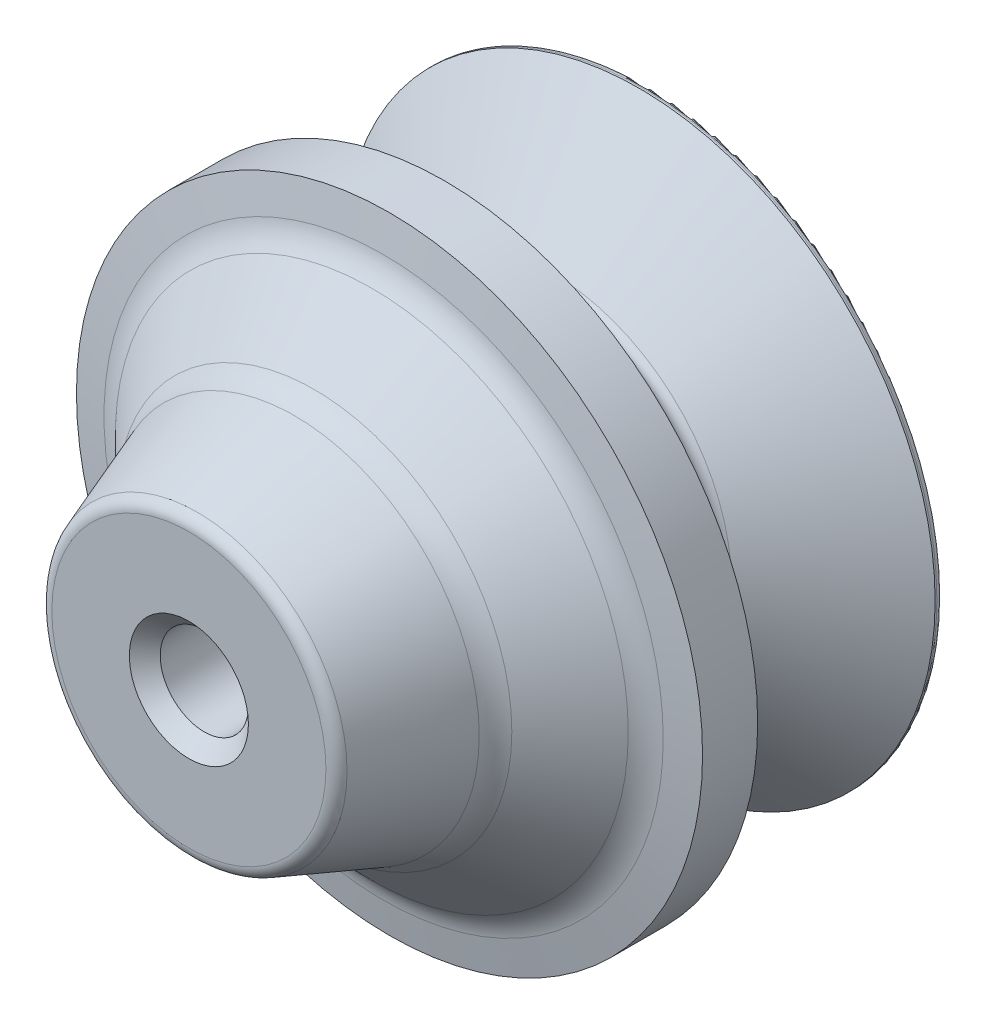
ISO-10303-21;
HEADER;
FILE_DESCRIPTION(('STEP AP214'),'2;1');
FILE_NAME('part.step','',(''),(''),'','','');
FILE_SCHEMA(('AUTOMOTIVE_DESIGN { 1 0 10303 214 1 1 1 1 }'));
ENDSEC;
DATA;
#1=APPLICATION_CONTEXT('core data for automotive mechanical design processes');
#2=APPLICATION_PROTOCOL_DEFINITION('international standard','automotive_design',2000,#1);
#3=PRODUCT_CONTEXT('',#1,'mechanical');
#4=PRODUCT('Part','Part','',(#3));
#5=PRODUCT_RELATED_PRODUCT_CATEGORY('part','',(#4));
#6=PRODUCT_DEFINITION_FORMATION('','',#4);
#7=PRODUCT_DEFINITION_CONTEXT('part definition',#1,'design');
#8=PRODUCT_DEFINITION('design','',#6,#7);
#9=PRODUCT_DEFINITION_SHAPE('','',#8);
#10=(LENGTH_UNIT() NAMED_UNIT(*) SI_UNIT(.MILLI.,.METRE.));
#11=(NAMED_UNIT(*) PLANE_ANGLE_UNIT() SI_UNIT($,.RADIAN.));
#12=(NAMED_UNIT(*) SI_UNIT($,.STERADIAN.) SOLID_ANGLE_UNIT());
#13=UNCERTAINTY_MEASURE_WITH_UNIT(LENGTH_MEASURE(1.E-05),#10,'distance_accuracy_value','');
#14=(GEOMETRIC_REPRESENTATION_CONTEXT(3) GLOBAL_UNCERTAINTY_ASSIGNED_CONTEXT((#13)) GLOBAL_UNIT_ASSIGNED_CONTEXT((#10,
#11,#12)) REPRESENTATION_CONTEXT('',''));
#15=CARTESIAN_POINT('',(0.,0.,0.));
#16=DIRECTION('',(0.,0.,1.));
#17=DIRECTION('',(1.,0.,0.));
#18=AXIS2_PLACEMENT_3D('',#15,#16,#17);
#19=CARTESIAN_POINT('',(0.,0.,-16.764));
#20=DIRECTION('',(0.,0.,1.));
#21=DIRECTION('',(1.,0.,0.));
#22=AXIS2_PLACEMENT_3D('',#19,#20,#21);
#23=TOROIDAL_SURFACE('',#22,16.7048948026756,2.032);
#24=CARTESIAN_POINT('',(0.,0.,-14.732));
#25=DIRECTION('',(0.,0.,1.));
#26=DIRECTION('',(1.,0.,0.));
#27=AXIS2_PLACEMENT_3D('',#24,#25,#26);
#28=CIRCLE('',#27,16.7048948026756);
#29=CARTESIAN_POINT('',(0.396874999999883,-16.7001796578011,-14.732));
#30=VERTEX_POINT('',#29);
#31=CARTESIAN_POINT('',(0.396875,16.7001796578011,-14.732));
#32=VERTEX_POINT('',#31);
#33=EDGE_CURVE('E735',#30,#32,#28,.T.);
#34=ORIENTED_EDGE('',*,*,#33,.F.);
#35=CARTESIAN_POINT('',(0.396874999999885,-16.4440842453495,-14.7481932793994));
#36=CARTESIAN_POINT('',(0.396874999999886,-16.330799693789,-14.7625821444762));
#37=CARTESIAN_POINT('',(0.396874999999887,-16.2186476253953,-14.7865474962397));
#38=CARTESIAN_POINT('',(0.396874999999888,-15.9998657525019,-14.8529883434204));
#39=CARTESIAN_POINT('',(0.396874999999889,-15.8932427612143,-14.8954860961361));
#40=CARTESIAN_POINT('',(0.39687499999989,-15.688687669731,-14.9977668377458));
#41=CARTESIAN_POINT('',(0.396874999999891,-15.5907515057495,-15.057541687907));
#42=CARTESIAN_POINT('',(0.396874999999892,-15.4063341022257,-15.1926718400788));
#43=CARTESIAN_POINT('',(0.396874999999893,-15.3198500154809,-15.2680232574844));
#44=CARTESIAN_POINT('',(0.396874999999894,-15.1607651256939,-15.4321750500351));
#45=CARTESIAN_POINT('',(0.396874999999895,-15.0881637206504,-15.5209748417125));
#46=CARTESIAN_POINT('',(0.396874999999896,-14.9589027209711,-15.7095096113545));
#47=CARTESIAN_POINT('',(0.396874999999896,-14.9022437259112,-15.8092450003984));
#48=CARTESIAN_POINT('',(0.396874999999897,-14.8065000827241,-16.0167801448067));
#49=CARTESIAN_POINT('',(0.396874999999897,-14.7674093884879,-16.1245771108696));
#50=CARTESIAN_POINT('',(0.396874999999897,-14.7078864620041,-16.3452046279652));
#51=CARTESIAN_POINT('',(0.396874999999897,-14.6874541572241,-16.4580351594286));
#52=CARTESIAN_POINT('',(0.396874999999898,-14.6658327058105,-16.6854921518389));
#53=CARTESIAN_POINT('',(0.396874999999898,-14.6646379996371,-16.8001180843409));
#54=CARTESIAN_POINT('',(0.396874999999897,-14.6815114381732,-17.0279429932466));
#55=CARTESIAN_POINT('',(0.396874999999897,-14.6995795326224,-17.1411419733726));
#56=CARTESIAN_POINT('',(0.396874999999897,-14.7544619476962,-17.3628902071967));
#57=CARTESIAN_POINT('',(0.396874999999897,-14.7912746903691,-17.471439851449));
#58=CARTESIAN_POINT('',(0.396874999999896,-14.8825985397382,-17.680819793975));
#59=CARTESIAN_POINT('',(0.396874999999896,-14.9371096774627,-17.7816500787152));
#60=CARTESIAN_POINT('',(0.396874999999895,-15.0622918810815,-17.9727484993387));
#61=CARTESIAN_POINT('',(0.396874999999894,-15.1329657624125,-18.0630147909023));
#62=CARTESIAN_POINT('',(0.396874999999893,-15.2884602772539,-18.2304059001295));
#63=CARTESIAN_POINT('',(0.396874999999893,-15.3732809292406,-18.3075307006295));
#64=CARTESIAN_POINT('',(0.396874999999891,-15.5546907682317,-18.446476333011));
#65=CARTESIAN_POINT('',(0.396874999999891,-15.6512837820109,-18.5082921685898));
#66=CARTESIAN_POINT('',(0.396874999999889,-15.8534744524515,-18.6148354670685));
#67=CARTESIAN_POINT('',(0.396874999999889,-15.9590721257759,-18.6595628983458));
#68=CARTESIAN_POINT('',(0.396874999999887,-16.1763079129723,-18.7306724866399));
#69=CARTESIAN_POINT('',(0.396874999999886,-16.2879477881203,-18.7570492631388));
#70=CARTESIAN_POINT('',(0.396874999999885,-16.5140711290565,-18.7906883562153));
#71=CARTESIAN_POINT('',(0.396874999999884,-16.6285545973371,-18.7979506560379));
#72=CARTESIAN_POINT('',(0.396874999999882,-16.8571305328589,-18.7931540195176));
#73=CARTESIAN_POINT('',(0.396874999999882,-16.9712229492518,-18.7810926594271));
#74=CARTESIAN_POINT('',(0.39687499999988,-17.1957631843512,-18.7379853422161));
#75=CARTESIAN_POINT('',(0.396874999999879,-17.3062110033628,-18.7069393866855));
#76=CARTESIAN_POINT('',(0.396874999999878,-17.5203181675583,-18.6267453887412));
#77=CARTESIAN_POINT('',(0.396874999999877,-17.6239779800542,-18.577598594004));
#78=CARTESIAN_POINT('',(0.396874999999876,-17.8215729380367,-18.4625961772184));
#79=CARTESIAN_POINT('',(0.396874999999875,-17.9155080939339,-18.3967405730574));
#80=CARTESIAN_POINT('',(0.396874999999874,-18.0909665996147,-18.2502039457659));
#81=CARTESIAN_POINT('',(0.396874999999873,-18.1724924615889,-18.169525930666));
#82=CARTESIAN_POINT('',(0.396874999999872,-18.3208384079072,-17.9956250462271));
#83=CARTESIAN_POINT('',(0.396874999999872,-18.3876585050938,-17.9024021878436));
#84=CARTESIAN_POINT('',(0.396874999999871,-18.5046791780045,-17.7060820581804));
#85=CARTESIAN_POINT('',(0.39687499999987,-18.5548837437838,-17.6029871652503));
#86=CARTESIAN_POINT('',(0.39687499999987,-18.6372682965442,-17.3898310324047));
#87=CARTESIAN_POINT('',(0.39687499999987,-18.6694483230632,-17.2797698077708));
#88=CARTESIAN_POINT('',(0.396874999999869,-18.7148646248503,-17.0558278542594));
#89=CARTESIAN_POINT('',(0.396874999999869,-18.7281045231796,-16.941947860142));
#90=CARTESIAN_POINT('',(0.396874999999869,-18.7352758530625,-16.7135813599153));
#91=CARTESIAN_POINT('',(0.396874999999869,-18.7292072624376,-16.5990948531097));
#92=CARTESIAN_POINT('',(0.396874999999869,-18.6979354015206,-16.3727756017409));
#93=CARTESIAN_POINT('',(0.39687499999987,-18.6727337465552,-16.2609426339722));
#94=CARTESIAN_POINT('',(0.39687499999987,-18.6039137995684,-16.0430944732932));
#95=CARTESIAN_POINT('',(0.39687499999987,-18.5602954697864,-15.937079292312));
#96=CARTESIAN_POINT('',(0.396874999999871,-18.4558780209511,-15.7338684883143));
#97=CARTESIAN_POINT('',(0.396874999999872,-18.3950777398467,-15.6366734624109));
#98=CARTESIAN_POINT('',(0.396874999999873,-18.258027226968,-15.4538721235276));
#99=CARTESIAN_POINT('',(0.396874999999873,-18.1817775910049,-15.3682653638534));
#100=CARTESIAN_POINT('',(0.396874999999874,-18.0159879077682,-15.2110585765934));
#101=CARTESIAN_POINT('',(0.396874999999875,-17.9264470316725,-15.1394594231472));
#102=CARTESIAN_POINT('',(0.396874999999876,-17.7365924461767,-15.0122880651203));
#103=CARTESIAN_POINT('',(0.396874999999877,-17.636276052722,-14.9567198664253));
#104=CARTESIAN_POINT('',(0.396874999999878,-17.4276768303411,-14.8631754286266));
#105=CARTESIAN_POINT('',(0.396874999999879,-17.3193883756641,-14.8252117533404));
#106=CARTESIAN_POINT('',(0.396874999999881,-17.0980629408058,-14.7680472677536));
#107=CARTESIAN_POINT('',(0.396874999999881,-16.9850318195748,-14.7488239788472));
#108=CARTESIAN_POINT('',(0.396874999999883,-16.8001587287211,-14.7332028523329));
#109=CARTESIAN_POINT('',(0.396874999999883,-16.7287606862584,-14.7309497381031));
#110=CARTESIAN_POINT('',(0.396874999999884,-16.5861224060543,-14.7339487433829));
#111=CARTESIAN_POINT('',(0.396874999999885,-16.5148821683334,-14.7392008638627));
#112=CARTESIAN_POINT('',(0.396874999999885,-16.4440842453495,-14.7481932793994));
#113=B_SPLINE_CURVE_WITH_KNOTS('',3,(#35,#36,#37,#38,#39,#40,#41,#42,#43,#44,#45,#46,#47,#48,
#49,#50,#51,#52,#53,#54,#55,#56,#57,#58,#59,#60,#61,#62,#63,#64,#65,#66,#67,#68,#69,#70,#71,#72,
#73,#74,#75,#76,#77,#78,#79,#80,#81,#82,#83,#84,#85,#86,#87,#88,#89,#90,#91,#92,#93,#94,#95,#96,
#97,#98,#99,#100,#101,#102,#103,#104,#105,#106,#107,#108,#109,#110,#111,#112),.UNSPECIFIED.,.T.,
.F.,(4,2,2,2,2,2,2,2,2,2,2,2,2,2,2,2,2,2,2,2,2,2,2,2,2,2,2,2,2,2,2,2,2,2,2,2,2,2,4),(0.,
0.342323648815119,0.685059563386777,1.02763428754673,1.37012368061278,1.71259821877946,
2.0550856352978,2.39745509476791,2.73982322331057,3.08209240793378,3.42436069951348,
3.76660018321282,4.10884026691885,4.45114001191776,4.79344020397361,5.13585196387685,
5.47826435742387,5.82077710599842,6.16329015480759,6.50584616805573,6.84840215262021,
7.19093452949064,7.53346653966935,7.87592911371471,8.21839138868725,8.56077136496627,
8.90315059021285,9.2454643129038,9.58777842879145,9.93006364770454,10.2723495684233,
10.6146586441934,10.9569545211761,11.2992717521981,11.641674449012,11.9843211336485,
12.3265563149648,12.5404936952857,12.7544311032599),.UNSPECIFIED.);
#114=CARTESIAN_POINT('',(0.396874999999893,-15.2856486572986,-15.3047673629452));
#115=VERTEX_POINT('',#114);
#116=EDGE_CURVE('E242',#30,#115,#113,.T.);
#117=ORIENTED_EDGE('',*,*,#116,.T.);
#118=CARTESIAN_POINT('',(0.,0.,-15.3047673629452));
#119=DIRECTION('',(0.,0.,1.));
#120=DIRECTION('',(1.,0.,0.));
#121=AXIS2_PLACEMENT_3D('',#118,#119,#120);
#122=CIRCLE('',#121,15.2908);
#123=CARTESIAN_POINT('',(0.396875,15.2856486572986,-15.3047673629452));
#124=VERTEX_POINT('',#123);
#125=EDGE_CURVE('E738',#115,#124,#122,.T.);
#126=ORIENTED_EDGE('',*,*,#125,.T.);
#127=CARTESIAN_POINT('',(0.396875,15.3359397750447,-15.2576741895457));
#128=CARTESIAN_POINT('',(0.396875,15.2513201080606,-15.3342696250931));
#129=CARTESIAN_POINT('',(0.396875,15.1731056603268,-15.4180650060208));
#130=CARTESIAN_POINT('',(0.396875,15.0317907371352,-15.5976679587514));
#131=CARTESIAN_POINT('',(0.396875,14.9687085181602,-15.6934898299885));
#132=CARTESIAN_POINT('',(0.396875,14.859555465,-15.8943310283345));
#133=CARTESIAN_POINT('',(0.396875,14.8134767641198,-15.9993460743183));
#134=CARTESIAN_POINT('',(0.396875,14.7396222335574,-16.2155943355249));
#135=CARTESIAN_POINT('',(0.396875,14.7118418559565,-16.3268259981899));
#136=CARTESIAN_POINT('',(0.396875,14.6753553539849,-16.5523619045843));
#137=CARTESIAN_POINT('',(0.396875,14.6666469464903,-16.6666657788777));
#138=CARTESIAN_POINT('',(0.396875,14.6685464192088,-16.8951171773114));
#139=CARTESIAN_POINT('',(0.396875,14.6791550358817,-17.0092646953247));
#140=CARTESIAN_POINT('',(0.396875,14.7193846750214,-17.2341406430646));
#141=CARTESIAN_POINT('',(0.396875,14.7490027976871,-17.3448695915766));
#142=CARTESIAN_POINT('',(0.396875,14.8264060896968,-17.5597841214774));
#143=CARTESIAN_POINT('',(0.396875,14.8741912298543,-17.6639697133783));
#144=CARTESIAN_POINT('',(0.396875,14.9865773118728,-17.8628555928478));
#145=CARTESIAN_POINT('',(0.396875,15.0511804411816,-17.9575546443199));
#146=CARTESIAN_POINT('',(0.396875,15.1953636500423,-18.1347668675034));
#147=CARTESIAN_POINT('',(0.396875,15.274943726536,-18.2172800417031));
#148=CARTESIAN_POINT('',(0.396875,15.4468481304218,-18.3678059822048));
#149=CARTESIAN_POINT('',(0.396875,15.5391764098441,-18.4358142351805));
#150=CARTESIAN_POINT('',(0.396875,15.7339372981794,-18.5553707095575));
#151=CARTESIAN_POINT('',(0.396875,15.8363699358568,-18.6069188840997));
#152=CARTESIAN_POINT('',(0.396875,16.0484662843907,-18.69210799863));
#153=CARTESIAN_POINT('',(0.396875,16.1581322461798,-18.7257433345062));
#154=CARTESIAN_POINT('',(0.396875,16.3815540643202,-18.7741286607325));
#155=CARTESIAN_POINT('',(0.396875,16.4953099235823,-18.7888786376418));
#156=CARTESIAN_POINT('',(0.396875,16.7237023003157,-18.799075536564));
#157=CARTESIAN_POINT('',(0.396875,16.838338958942,-18.7945192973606));
#158=CARTESIAN_POINT('',(0.396875,17.0652202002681,-18.7662250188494));
#159=CARTESIAN_POINT('',(0.396875,17.1774647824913,-18.7424869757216));
#160=CARTESIAN_POINT('',(0.396875,17.3963710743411,-18.6765025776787));
#161=CARTESIAN_POINT('',(0.396875,17.5030329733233,-18.6342568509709));
#162=CARTESIAN_POINT('',(0.396875,17.7077485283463,-18.5324547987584));
#163=CARTESIAN_POINT('',(0.396875,17.8058021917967,-18.472898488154));
#164=CARTESIAN_POINT('',(0.396875,17.9904982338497,-18.3381771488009));
#165=CARTESIAN_POINT('',(0.396875,18.0771427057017,-18.2630149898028));
#166=CARTESIAN_POINT('',(0.396875,18.2365794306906,-18.0992079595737));
#167=CARTESIAN_POINT('',(0.396875,18.3093717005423,-18.010563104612));
#168=CARTESIAN_POINT('',(0.396875,18.439019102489,-17.8223299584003));
#169=CARTESIAN_POINT('',(0.396875,18.4958780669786,-17.7227443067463));
#170=CARTESIAN_POINT('',(0.396875,18.5920659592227,-17.5154392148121));
#171=CARTESIAN_POINT('',(0.396875,18.6313949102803,-17.4077197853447));
#172=CARTESIAN_POINT('',(0.396875,18.6913984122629,-17.187228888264));
#173=CARTESIAN_POINT('',(0.396875,18.7120768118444,-17.0744584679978));
#174=CARTESIAN_POINT('',(0.396875,18.7342053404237,-16.8470465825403));
#175=CARTESIAN_POINT('',(0.396875,18.7356554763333,-16.7324051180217));
#176=CARTESIAN_POINT('',(0.396875,18.7192871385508,-16.5045184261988));
#177=CARTESIAN_POINT('',(0.396875,18.7014707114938,-16.391273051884));
#178=CARTESIAN_POINT('',(0.396875,18.6470788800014,-16.1693808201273));
#179=CARTESIAN_POINT('',(0.396875,18.6105034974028,-16.0607339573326));
#180=CARTESIAN_POINT('',(0.396875,18.5196320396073,-15.8511196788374));
#181=CARTESIAN_POINT('',(0.396875,18.4653355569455,-15.7501524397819));
#182=CARTESIAN_POINT('',(0.396875,18.3405645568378,-15.5587647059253));
#183=CARTESIAN_POINT('',(0.396875,18.2700900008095,-15.4683442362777));
#184=CARTESIAN_POINT('',(0.396875,18.1149530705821,-15.3006025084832));
#185=CARTESIAN_POINT('',(0.396875,18.0302886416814,-15.2232831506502));
#186=CARTESIAN_POINT('',(0.396875,17.8491830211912,-15.0839518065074));
#187=CARTESIAN_POINT('',(0.396875,17.7527417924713,-15.0219398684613));
#188=CARTESIAN_POINT('',(0.396875,17.5507951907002,-14.9149676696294));
#189=CARTESIAN_POINT('',(0.396875,17.4452875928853,-14.8700116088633));
#190=CARTESIAN_POINT('',(0.396875,17.2282275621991,-14.7984480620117));
#191=CARTESIAN_POINT('',(0.396875,17.1166753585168,-14.7718398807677));
#192=CARTESIAN_POINT('',(0.396875,16.8906738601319,-14.7377196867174));
#193=CARTESIAN_POINT('',(0.396875,16.7762241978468,-14.7302101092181));
#194=CARTESIAN_POINT('',(0.396875,16.5476570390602,-14.7345091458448));
#195=CARTESIAN_POINT('',(0.396875,16.433539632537,-14.7463225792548));
#196=CARTESIAN_POINT('',(0.396875,16.2088472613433,-14.7889458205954));
#197=CARTESIAN_POINT('',(0.396875,16.0982745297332,-14.8197673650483));
#198=CARTESIAN_POINT('',(0.396875,15.883972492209,-14.8995269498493));
#199=CARTESIAN_POINT('',(0.396875,15.7802351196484,-14.9484431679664));
#200=CARTESIAN_POINT('',(0.396875,15.6195928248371,-15.0414518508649));
#201=CARTESIAN_POINT('',(0.396875,15.5597014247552,-15.0804871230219));
#202=CARTESIAN_POINT('',(0.396875,15.4443505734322,-15.1646332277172));
#203=CARTESIAN_POINT('',(0.396875,15.3888911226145,-15.2097440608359));
#204=CARTESIAN_POINT('',(0.396875,15.3359397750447,-15.2576741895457));
#205=B_SPLINE_CURVE_WITH_KNOTS('',3,(#127,#128,#129,#130,#131,#132,#133,#134,#135,#136,#137,
#138,#139,#140,#141,#142,#143,#144,#145,#146,#147,#148,#149,#150,#151,#152,#153,#154,#155,#156,
#157,#158,#159,#160,#161,#162,#163,#164,#165,#166,#167,#168,#169,#170,#171,#172,#173,#174,#175,
#176,#177,#178,#179,#180,#181,#182,#183,#184,#185,#186,#187,#188,#189,#190,#191,#192,#193,#194,
#195,#196,#197,#198,#199,#200,#201,#202,#203,#204),.UNSPECIFIED.,.T.,.F.,(4,2,2,2,2,2,2,2,2,2,2,
2,2,2,2,2,2,2,2,2,2,2,2,2,2,2,2,2,2,2,2,2,2,2,2,2,2,2,4),(0.,0.342151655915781,
0.684714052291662,1.02711776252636,1.3694363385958,1.71171393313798,2.05400457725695,
2.39624301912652,2.73848091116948,3.08076333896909,3.42304569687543,3.76543440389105,
4.10782408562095,4.45032082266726,4.79281780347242,5.13537086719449,5.47792399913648,
5.8204655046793,6.16300671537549,6.50548499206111,6.84796285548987,7.19035827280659,
7.53275323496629,7.87507752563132,8.21740169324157,8.55968950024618,8.90197690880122,
9.24427218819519,9.5865682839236,9.92891398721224,10.2712607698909,10.6136918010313,
10.9561098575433,11.298571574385,11.6411187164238,11.9838775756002,12.3262244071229,
12.5403281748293,12.7544319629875),.UNSPECIFIED.);
#206=EDGE_CURVE('E350',#32,#124,#205,.T.);
#207=ORIENTED_EDGE('',*,*,#206,.F.);
#208=EDGE_LOOP('',(#34,#117,#126,#207));
#209=FACE_BOUND('',#208,.T.);
#210=ADVANCED_FACE('F16',(#209),#23,.F.);
#211=CARTESIAN_POINT('',(0.,0.,0.));
#212=DIRECTION('',(0.,0.,1.));
#213=DIRECTION('',(1.,0.,0.));
#214=AXIS2_PLACEMENT_3D('',#211,#212,#213);
#215=PLANE('',#214);
#216=CARTESIAN_POINT('',(0.,0.,0.));
#217=DIRECTION('',(0.,0.,1.));
#218=DIRECTION('',(1.,0.,0.));
#219=AXIS2_PLACEMENT_3D('',#216,#217,#218);
#220=CIRCLE('',#219,3.429);
#221=CARTESIAN_POINT('',(3.429,0.,0.));
#222=VERTEX_POINT('',#221);
#223=EDGE_CURVE('E1448',#222,#222,#220,.T.);
#224=ORIENTED_EDGE('',*,*,#223,.F.);
#225=EDGE_LOOP('',(#224));
#226=FACE_BOUND('',#225,.T.);
#227=CARTESIAN_POINT('',(0.,0.,0.));
#228=DIRECTION('',(0.,0.,1.));
#229=DIRECTION('',(1.,0.,0.));
#230=AXIS2_PLACEMENT_3D('',#227,#228,#229);
#231=CIRCLE('',#230,7.89455422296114);
#232=CARTESIAN_POINT('',(7.89455422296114,0.,0.));
#233=VERTEX_POINT('',#232);
#234=EDGE_CURVE('E725',#233,#233,#231,.T.);
#235=ORIENTED_EDGE('',*,*,#234,.T.);
#236=EDGE_LOOP('',(#235));
#237=FACE_BOUND('',#236,.T.);
#238=ADVANCED_FACE('F547',(#226,#237),#215,.T.);
#239=CARTESIAN_POINT('',(0.,0.,-26.416));
#240=DIRECTION('',(0.,0.,1.));
#241=DIRECTION('',(1.,0.,0.));
#242=AXIS2_PLACEMENT_3D('',#239,#240,#241);
#243=PLANE('',#242);
#244=CARTESIAN_POINT('',(0.,0.,-26.416));
#245=DIRECTION('',(0.,0.,1.));
#246=DIRECTION('',(1.,0.,0.));
#247=AXIS2_PLACEMENT_3D('',#244,#245,#246);
#248=CIRCLE('',#247,15.9512);
#249=CARTESIAN_POINT('',(15.9512,0.,-26.416));
#250=VERTEX_POINT('',#249);
#251=EDGE_CURVE('E1439',#250,#250,#248,.T.);
#252=ORIENTED_EDGE('',*,*,#251,.T.);
#253=EDGE_LOOP('',(#252));
#254=FACE_BOUND('',#253,.T.);
#255=CARTESIAN_POINT('',(0.,0.,-26.416));
#256=DIRECTION('',(0.,0.,1.));
#257=DIRECTION('',(1.,0.,0.));
#258=AXIS2_PLACEMENT_3D('',#255,#256,#257);
#259=CIRCLE('',#258,16.6740692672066);
#260=CARTESIAN_POINT('',(16.6740692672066,0.,-26.416));
#261=VERTEX_POINT('',#260);
#262=EDGE_CURVE('E694',#261,#261,#259,.F.);
#263=ORIENTED_EDGE('',*,*,#262,.T.);
#264=EDGE_LOOP('',(#263));
#265=FACE_BOUND('',#264,.T.);
#266=ADVANCED_FACE('F553',(#254,#265),#243,.F.);
#267=CARTESIAN_POINT('',(0.,0.,-26.416));
#268=DIRECTION('',(0.,0.,1.));
#269=DIRECTION('',(1.,0.,0.));
#270=AXIS2_PLACEMENT_3D('',#267,#268,#269);
#271=CYLINDRICAL_SURFACE('',#270,18.034);
#272=CARTESIAN_POINT('',(0.,0.,-11.557));
#273=DIRECTION('',(0.,0.,1.));
#274=DIRECTION('',(1.,0.,0.));
#275=AXIS2_PLACEMENT_3D('',#272,#273,#274);
#276=CIRCLE('',#275,18.034);
#277=CARTESIAN_POINT('',(18.034,0.,-11.557));
#278=VERTEX_POINT('',#277);
#279=EDGE_CURVE('E721',#278,#278,#276,.T.);
#280=CARTESIAN_POINT('',(0.,0.,-14.732));
#281=DIRECTION('',(0.,0.,1.));
#282=DIRECTION('',(1.,0.,0.));
#283=AXIS2_PLACEMENT_3D('',#280,#281,#282);
#284=CIRCLE('',#283,18.034);
#285=CARTESIAN_POINT('',(18.034,0.,-14.732));
#286=VERTEX_POINT('',#285);
#287=EDGE_CURVE('E729',#286,#286,#284,.T.);
#288=CARTESIAN_POINT('',(18.034,0.,-11.557));
#289=CARTESIAN_POINT('',(18.034,0.,-11.5900729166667));
#290=CARTESIAN_POINT('',(18.034,0.,-11.6231458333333));
#291=CARTESIAN_POINT('',(18.034,0.,-11.6892916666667));
#292=CARTESIAN_POINT('',(18.034,0.,-11.7223645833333));
#293=CARTESIAN_POINT('',(18.034,0.,-11.7885104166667));
#294=CARTESIAN_POINT('',(18.034,0.,-11.8215833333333));
#295=CARTESIAN_POINT('',(18.034,0.,-11.8877291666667));
#296=CARTESIAN_POINT('',(18.034,0.,-11.9208020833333));
#297=CARTESIAN_POINT('',(18.034,0.,-11.9869479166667));
#298=CARTESIAN_POINT('',(18.034,0.,-12.0200208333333));
#299=CARTESIAN_POINT('',(18.034,0.,-12.0861666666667));
#300=CARTESIAN_POINT('',(18.034,0.,-12.1192395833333));
#301=CARTESIAN_POINT('',(18.034,0.,-12.1853854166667));
#302=CARTESIAN_POINT('',(18.034,0.,-12.2184583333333));
#303=CARTESIAN_POINT('',(18.034,0.,-12.2846041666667));
#304=CARTESIAN_POINT('',(18.034,0.,-12.3176770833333));
#305=CARTESIAN_POINT('',(18.034,0.,-12.3838229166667));
#306=CARTESIAN_POINT('',(18.034,0.,-12.4168958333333));
#307=CARTESIAN_POINT('',(18.034,0.,-12.4830416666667));
#308=CARTESIAN_POINT('',(18.034,0.,-12.5161145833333));
#309=CARTESIAN_POINT('',(18.034,0.,-12.5822604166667));
#310=CARTESIAN_POINT('',(18.034,0.,-12.6153333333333));
#311=CARTESIAN_POINT('',(18.034,0.,-12.6814791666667));
#312=CARTESIAN_POINT('',(18.034,0.,-12.7145520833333));
#313=CARTESIAN_POINT('',(18.034,0.,-12.7806979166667));
#314=CARTESIAN_POINT('',(18.034,0.,-12.8137708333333));
#315=CARTESIAN_POINT('',(18.034,0.,-12.8799166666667));
#316=CARTESIAN_POINT('',(18.034,0.,-12.9129895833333));
#317=CARTESIAN_POINT('',(18.034,0.,-12.9791354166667));
#318=CARTESIAN_POINT('',(18.034,0.,-13.0122083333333));
#319=CARTESIAN_POINT('',(18.034,0.,-13.0783541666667));
#320=CARTESIAN_POINT('',(18.034,0.,-13.1114270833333));
#321=CARTESIAN_POINT('',(18.034,0.,-13.1775729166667));
#322=CARTESIAN_POINT('',(18.034,0.,-13.2106458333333));
#323=CARTESIAN_POINT('',(18.034,0.,-13.2767916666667));
#324=CARTESIAN_POINT('',(18.034,0.,-13.3098645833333));
#325=CARTESIAN_POINT('',(18.034,0.,-13.3760104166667));
#326=CARTESIAN_POINT('',(18.034,0.,-13.4090833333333));
#327=CARTESIAN_POINT('',(18.034,0.,-13.4752291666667));
#328=CARTESIAN_POINT('',(18.034,0.,-13.5083020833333));
#329=CARTESIAN_POINT('',(18.034,0.,-13.5744479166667));
#330=CARTESIAN_POINT('',(18.034,0.,-13.6075208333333));
#331=CARTESIAN_POINT('',(18.034,0.,-13.6736666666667));
#332=CARTESIAN_POINT('',(18.034,0.,-13.7067395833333));
#333=CARTESIAN_POINT('',(18.034,0.,-13.7728854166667));
#334=CARTESIAN_POINT('',(18.034,0.,-13.8059583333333));
#335=CARTESIAN_POINT('',(18.034,0.,-13.8721041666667));
#336=CARTESIAN_POINT('',(18.034,0.,-13.9051770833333));
#337=CARTESIAN_POINT('',(18.034,0.,-13.9713229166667));
#338=CARTESIAN_POINT('',(18.034,0.,-14.0043958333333));
#339=CARTESIAN_POINT('',(18.034,0.,-14.0705416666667));
#340=CARTESIAN_POINT('',(18.034,0.,-14.1036145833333));
#341=CARTESIAN_POINT('',(18.034,0.,-14.1697604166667));
#342=CARTESIAN_POINT('',(18.034,0.,-14.2028333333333));
#343=CARTESIAN_POINT('',(18.034,0.,-14.2689791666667));
#344=CARTESIAN_POINT('',(18.034,0.,-14.3020520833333));
#345=CARTESIAN_POINT('',(18.034,0.,-14.3681979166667));
#346=CARTESIAN_POINT('',(18.034,0.,-14.4012708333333));
#347=CARTESIAN_POINT('',(18.034,0.,-14.4674166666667));
#348=CARTESIAN_POINT('',(18.034,0.,-14.5004895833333));
#349=CARTESIAN_POINT('',(18.034,0.,-14.5666354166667));
#350=CARTESIAN_POINT('',(18.034,0.,-14.5997083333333));
#351=CARTESIAN_POINT('',(18.034,0.,-14.6658541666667));
#352=CARTESIAN_POINT('',(18.034,0.,-14.6989270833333));
#353=CARTESIAN_POINT('',(18.034,0.,-14.732));
#354=B_SPLINE_CURVE_WITH_KNOTS('',3,(#288,#289,#290,#291,#292,#293,#294,#295,#296,#297,#298,
#299,#300,#301,#302,#303,#304,#305,#306,#307,#308,#309,#310,#311,#312,#313,#314,#315,#316,#317,
#318,#319,#320,#321,#322,#323,#324,#325,#326,#327,#328,#329,#330,#331,#332,#333,#334,#335,#336,
#337,#338,#339,#340,#341,#342,#343,#344,#345,#346,#347,#348,#349,#350,#351,#352,#353),
.UNSPECIFIED.,.F.,.F.,(4,2,2,2,2,2,2,2,2,2,2,2,2,2,2,2,2,2,2,2,2,2,2,2,2,2,2,2,2,2,2,2,4),(0.,
0.0992187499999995,0.198437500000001,0.29765625,0.396875,0.496093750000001,0.5953125,0.69453125,
0.793749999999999,0.892968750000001,0.9921875,1.09140625,1.190625,1.28984375,1.3890625,
1.48828125,1.5875,1.68671875,1.7859375,1.88515625,1.984375,2.08359375,2.1828125,2.28203125,
2.38125,2.48046875,2.5796875,2.67890625,2.778125,2.87734375,2.9765625,3.07578125,3.175),.UNSPECIFIED.);
#355=EDGE_CURVE('BSEAM592',#278,#286,#354,.T.);
#356=ORIENTED_EDGE('',*,*,#279,.F.);
#357=ORIENTED_EDGE('',*,*,#287,.T.);
#358=ORIENTED_EDGE('',*,*,#355,.T.);
#359=ORIENTED_EDGE('',*,*,#355,.F.);
#360=EDGE_LOOP('',(#356,#358,#357,#359));
#361=FACE_BOUND('',#360,.T.);
#362=ADVANCED_FACE('F592',(#361),#271,.T.);
#363=CARTESIAN_POINT('',(0.,0.,-0.762));
#364=DIRECTION('',(0.,0.,1.));
#365=DIRECTION('',(1.,0.,0.));
#366=AXIS2_PLACEMENT_3D('',#363,#364,#365);
#367=TOROIDAL_SURFACE('',#366,7.89455422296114,0.762000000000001);
#368=CARTESIAN_POINT('',(0.,0.,-0.501380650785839));
#369=DIRECTION('',(0.,0.,1.));
#370=DIRECTION('',(1.,0.,0.));
#371=AXIS2_PLACEMENT_3D('',#368,#369,#370);
#372=CIRCLE('',#371,8.6106);
#373=CARTESIAN_POINT('',(8.6106,0.,-0.501380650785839));
#374=VERTEX_POINT('',#373);
#375=EDGE_CURVE('E702',#374,#374,#372,.T.);
#376=ORIENTED_EDGE('',*,*,#375,.T.);
#377=EDGE_LOOP('',(#376));
#378=FACE_BOUND('',#377,.T.);
#379=ORIENTED_EDGE('',*,*,#234,.F.);
#380=EDGE_LOOP('',(#379));
#381=FACE_BOUND('',#380,.T.);
#382=ADVANCED_FACE('F589',(#378,#381),#367,.T.);
#383=CARTESIAN_POINT('',(0.,0.,-0.501380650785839));
#384=DIRECTION('',(0.,0.,-1.));
#385=DIRECTION('',(-1.,0.,0.));
#386=AXIS2_PLACEMENT_3D('',#383,#384,#385);
#387=CONICAL_SURFACE('',#386,8.6106,0.349065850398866);
#388=CARTESIAN_POINT('',(0.,0.,-6.08425476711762));
#389=DIRECTION('',(0.,0.,1.));
#390=DIRECTION('',(1.,0.,0.));
#391=AXIS2_PLACEMENT_3D('',#388,#389,#390);
#392=CIRCLE('',#391,10.6426);
#393=CARTESIAN_POINT('',(10.6426,0.,-6.08425476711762));
#394=VERTEX_POINT('',#393);
#395=EDGE_CURVE('E706',#394,#394,#392,.T.);
#396=ORIENTED_EDGE('',*,*,#395,.T.);
#397=EDGE_LOOP('',(#396));
#398=FACE_BOUND('',#397,.T.);
#399=ORIENTED_EDGE('',*,*,#375,.F.);
#400=EDGE_LOOP('',(#399));
#401=FACE_BOUND('',#400,.T.);
#402=ADVANCED_FACE('F585',(#398,#401),#387,.T.);
#403=CARTESIAN_POINT('',(0.,0.,-5.04177737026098));
#404=DIRECTION('',(0.,0.,1.));
#405=DIRECTION('',(1.,0.,0.));
#406=AXIS2_PLACEMENT_3D('',#403,#404,#405);
#407=TOROIDAL_SURFACE('',#406,13.5067831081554,3.048);
#408=CARTESIAN_POINT('',(0.,0.,-7.22436622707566));
#409=DIRECTION('',(0.,0.,1.));
#410=DIRECTION('',(1.,0.,0.));
#411=AXIS2_PLACEMENT_3D('',#408,#409,#410);
#412=CIRCLE('',#411,11.3792);
#413=CARTESIAN_POINT('',(11.3792,0.,-7.22436622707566));
#414=VERTEX_POINT('',#413);
#415=EDGE_CURVE('E710',#414,#414,#412,.T.);
#416=ORIENTED_EDGE('',*,*,#415,.T.);
#417=EDGE_LOOP('',(#416));
#418=FACE_BOUND('',#417,.T.);
#419=ORIENTED_EDGE('',*,*,#395,.F.);
#420=EDGE_LOOP('',(#419));
#421=FACE_BOUND('',#420,.T.);
#422=ADVANCED_FACE('F581',(#418,#421),#407,.F.);
#423=CARTESIAN_POINT('',(0.,0.,-7.22436622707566));
#424=DIRECTION('',(0.,0.,-1.));
#425=DIRECTION('',(-1.,0.,0.));
#426=AXIS2_PLACEMENT_3D('',#423,#424,#425);
#427=CONICAL_SURFACE('',#426,11.3792,0.798159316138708);
#428=CARTESIAN_POINT('',(0.,0.,-10.5346229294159));
#429=DIRECTION('',(0.,0.,1.));
#430=DIRECTION('',(1.,0.,0.));
#431=AXIS2_PLACEMENT_3D('',#428,#429,#430);
#432=CIRCLE('',#431,14.7750388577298);
#433=CARTESIAN_POINT('',(14.7750388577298,0.,-10.5346229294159));
#434=VERTEX_POINT('',#433);
#435=EDGE_CURVE('E714',#434,#434,#432,.T.);
#436=ORIENTED_EDGE('',*,*,#435,.T.);
#437=EDGE_LOOP('',(#436));
#438=FACE_BOUND('',#437,.T.);
#439=ORIENTED_EDGE('',*,*,#415,.F.);
#440=EDGE_LOOP('',(#439));
#441=FACE_BOUND('',#440,.T.);
#442=ADVANCED_FACE('F577',(#438,#441),#427,.T.);
#443=CARTESIAN_POINT('',(0.,0.,-8.71579888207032));
#444=DIRECTION('',(0.,0.,1.));
#445=DIRECTION('',(1.,0.,0.));
#446=AXIS2_PLACEMENT_3D('',#443,#444,#445);
#447=TOROIDAL_SURFACE('',#446,16.5480247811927,2.54);
#448=CARTESIAN_POINT('',(0.,0.,-11.2172105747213));
#449=DIRECTION('',(0.,0.,1.));
#450=DIRECTION('',(1.,0.,0.));
#451=AXIS2_PLACEMENT_3D('',#448,#449,#450);
#452=CIRCLE('',#451,16.1069584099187);
#453=CARTESIAN_POINT('',(16.1069584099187,0.,-11.2172105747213));
#454=VERTEX_POINT('',#453);
#455=EDGE_CURVE('E717',#454,#454,#452,.T.);
#456=ORIENTED_EDGE('',*,*,#455,.T.);
#457=EDGE_LOOP('',(#456));
#458=FACE_BOUND('',#457,.T.);
#459=ORIENTED_EDGE('',*,*,#435,.F.);
#460=EDGE_LOOP('',(#459));
#461=FACE_BOUND('',#460,.T.);
#462=ADVANCED_FACE('F569',(#458,#461),#447,.F.);
#463=CARTESIAN_POINT('',(0.,0.,-11.2172105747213));
#464=DIRECTION('',(0.,0.,-1.));
#465=DIRECTION('',(-1.,0.,0.));
#466=AXIS2_PLACEMENT_3D('',#463,#464,#465);
#467=CONICAL_SURFACE('',#466,16.1069584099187,1.39626340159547);
#468=ORIENTED_EDGE('',*,*,#279,.T.);
#469=EDGE_LOOP('',(#468));
#470=FACE_BOUND('',#469,.T.);
#471=ORIENTED_EDGE('',*,*,#455,.F.);
#472=EDGE_LOOP('',(#471));
#473=FACE_BOUND('',#472,.T.);
#474=ADVANCED_FACE('F563',(#470,#473),#467,.T.);
#475=CARTESIAN_POINT('',(0.,18.034,-14.732));
#476=DIRECTION('',(0.,0.,-1.));
#477=DIRECTION('',(-1.,0.,0.));
#478=AXIS2_PLACEMENT_3D('',#475,#476,#477);
#479=PLANE('',#478);
#480=DIRECTION('',(0.,1.,0.));
#481=VECTOR('',#480,1.);
#482=CARTESIAN_POINT('',(-0.396875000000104,-14.892882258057,-14.732));
#483=LINE('',#482,#481);
#484=CARTESIAN_POINT('',(-0.396875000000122,-17.526,-14.732));
#485=VERTEX_POINT('',#484);
#486=CARTESIAN_POINT('',(-0.396875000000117,-16.7001796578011,-14.732));
#487=VERTEX_POINT('',#486);
#488=EDGE_CURVE('E223',#485,#487,#483,.T.);
#489=ORIENTED_EDGE('',*,*,#488,.F.);
#490=DIRECTION('',(1.,0.,0.));
#491=VECTOR('',#490,1.);
#492=CARTESIAN_POINT('',(-0.396875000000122,-17.526,-14.732));
#493=LINE('',#492,#491);
#494=CARTESIAN_POINT('',(0.396874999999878,-17.526,-14.732));
#495=VERTEX_POINT('',#494);
#496=EDGE_CURVE('E212',#485,#495,#493,.T.);
#497=ORIENTED_EDGE('',*,*,#496,.T.);
#498=DIRECTION('',(0.,1.,0.));
#499=VECTOR('',#498,1.);
#500=CARTESIAN_POINT('',(0.396874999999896,-14.892882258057,-14.732));
#501=LINE('',#500,#499);
#502=EDGE_CURVE('E218',#495,#30,#501,.T.);
#503=ORIENTED_EDGE('',*,*,#502,.T.);
#504=ORIENTED_EDGE('',*,*,#33,.T.);
#505=DIRECTION('',(0.,-1.,0.));
#506=VECTOR('',#505,1.);
#507=CARTESIAN_POINT('',(0.396875,14.892882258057,-14.732));
#508=LINE('',#507,#506);
#509=CARTESIAN_POINT('',(0.396875,17.526,-14.732));
#510=VERTEX_POINT('',#509);
#511=EDGE_CURVE('E1331',#510,#32,#508,.T.);
#512=ORIENTED_EDGE('',*,*,#511,.F.);
#513=DIRECTION('',(-1.,0.,0.));
#514=VECTOR('',#513,1.);
#515=CARTESIAN_POINT('',(0.396875,17.526,-14.732));
#516=LINE('',#515,#514);
#517=CARTESIAN_POINT('',(-0.396875,17.526,-14.732));
#518=VERTEX_POINT('',#517);
#519=EDGE_CURVE('E1316',#510,#518,#516,.T.);
#520=ORIENTED_EDGE('',*,*,#519,.T.);
#521=DIRECTION('',(0.,-1.,0.));
#522=VECTOR('',#521,1.);
#523=CARTESIAN_POINT('',(-0.396875,14.892882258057,-14.732));
#524=LINE('',#523,#522);
#525=CARTESIAN_POINT('',(-0.396875,16.7001796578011,-14.732));
#526=VERTEX_POINT('',#525);
#527=EDGE_CURVE('E1346',#518,#526,#524,.T.);
#528=ORIENTED_EDGE('',*,*,#527,.T.);
#529=EDGE_CURVE('E508',#526,#487,#28,.T.);
#530=ORIENTED_EDGE('',*,*,#529,.T.);
#531=EDGE_LOOP('',(#489,#497,#503,#504,#512,#520,#528,#530));
#532=FACE_BOUND('',#531,.T.);
#533=ORIENTED_EDGE('',*,*,#287,.F.);
#534=EDGE_LOOP('',(#533));
#535=FACE_BOUND('',#534,.T.);
#536=ADVANCED_FACE('F558',(#532,#535),#479,.T.);
#537=CARTESIAN_POINT('',(-0.396875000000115,-16.4440842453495,-14.7481932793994));
#538=CARTESIAN_POINT('',(-0.396875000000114,-16.330799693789,-14.7625821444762));
#539=CARTESIAN_POINT('',(-0.396875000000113,-16.2186476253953,-14.7865474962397));
#540=CARTESIAN_POINT('',(-0.396875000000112,-15.9998657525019,-14.8529883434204));
#541=CARTESIAN_POINT('',(-0.396875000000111,-15.8932427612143,-14.8954860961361));
#542=CARTESIAN_POINT('',(-0.39687500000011,-15.688687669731,-14.9977668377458));
#543=CARTESIAN_POINT('',(-0.396875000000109,-15.5907515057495,-15.0575416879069));
#544=CARTESIAN_POINT('',(-0.396875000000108,-15.4063341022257,-15.1926718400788));
#545=CARTESIAN_POINT('',(-0.396875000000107,-15.3198500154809,-15.2680232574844));
#546=CARTESIAN_POINT('',(-0.396875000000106,-15.1607651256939,-15.4321750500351));
#547=CARTESIAN_POINT('',(-0.396875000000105,-15.0881637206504,-15.5209748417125));
#548=CARTESIAN_POINT('',(-0.396875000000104,-14.9589027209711,-15.7095096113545));
#549=CARTESIAN_POINT('',(-0.396875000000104,-14.9022437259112,-15.8092450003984));
#550=CARTESIAN_POINT('',(-0.396875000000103,-14.8065000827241,-16.0167801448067));
#551=CARTESIAN_POINT('',(-0.396875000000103,-14.7674093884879,-16.1245771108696));
#552=CARTESIAN_POINT('',(-0.396875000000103,-14.7078864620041,-16.3452046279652));
#553=CARTESIAN_POINT('',(-0.396875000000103,-14.6874541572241,-16.4580351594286));
#554=CARTESIAN_POINT('',(-0.396875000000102,-14.6658327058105,-16.6854921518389));
#555=CARTESIAN_POINT('',(-0.396875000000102,-14.6646379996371,-16.8001180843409));
#556=CARTESIAN_POINT('',(-0.396875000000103,-14.6815114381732,-17.0279429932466));
#557=CARTESIAN_POINT('',(-0.396875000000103,-14.6995795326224,-17.1411419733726));
#558=CARTESIAN_POINT('',(-0.396875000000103,-14.7544619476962,-17.3628902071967));
#559=CARTESIAN_POINT('',(-0.396875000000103,-14.7912746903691,-17.471439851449));
#560=CARTESIAN_POINT('',(-0.396875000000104,-14.8825985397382,-17.680819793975));
#561=CARTESIAN_POINT('',(-0.396875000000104,-14.9371096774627,-17.7816500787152));
#562=CARTESIAN_POINT('',(-0.396875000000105,-15.0622918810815,-17.9727484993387));
#563=CARTESIAN_POINT('',(-0.396875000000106,-15.1329657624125,-18.0630147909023));
#564=CARTESIAN_POINT('',(-0.396875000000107,-15.2884602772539,-18.2304059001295));
#565=CARTESIAN_POINT('',(-0.396875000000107,-15.3732809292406,-18.3075307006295));
#566=CARTESIAN_POINT('',(-0.396875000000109,-15.5546907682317,-18.446476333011));
#567=CARTESIAN_POINT('',(-0.396875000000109,-15.6512837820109,-18.5082921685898));
#568=CARTESIAN_POINT('',(-0.396875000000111,-15.8534744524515,-18.6148354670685));
#569=CARTESIAN_POINT('',(-0.396875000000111,-15.9590721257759,-18.6595628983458));
#570=CARTESIAN_POINT('',(-0.396875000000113,-16.1763079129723,-18.7306724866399));
#571=CARTESIAN_POINT('',(-0.396875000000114,-16.2879477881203,-18.7570492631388));
#572=CARTESIAN_POINT('',(-0.396875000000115,-16.5140711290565,-18.7906883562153));
#573=CARTESIAN_POINT('',(-0.396875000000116,-16.6285545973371,-18.7979506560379));
#574=CARTESIAN_POINT('',(-0.396875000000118,-16.8571305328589,-18.7931540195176));
#575=CARTESIAN_POINT('',(-0.396875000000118,-16.9712229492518,-18.7810926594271));
#576=CARTESIAN_POINT('',(-0.39687500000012,-17.1957631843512,-18.7379853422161));
#577=CARTESIAN_POINT('',(-0.396875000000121,-17.3062110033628,-18.7069393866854));
#578=CARTESIAN_POINT('',(-0.396875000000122,-17.5203181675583,-18.6267453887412));
#579=CARTESIAN_POINT('',(-0.396875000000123,-17.6239779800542,-18.577598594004));
#580=CARTESIAN_POINT('',(-0.396875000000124,-17.8215729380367,-18.4625961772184));
#581=CARTESIAN_POINT('',(-0.396875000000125,-17.9155080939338,-18.3967405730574));
#582=CARTESIAN_POINT('',(-0.396875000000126,-18.0909665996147,-18.2502039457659));
#583=CARTESIAN_POINT('',(-0.396875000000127,-18.1724924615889,-18.169525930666));
#584=CARTESIAN_POINT('',(-0.396875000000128,-18.3208384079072,-17.9956250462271));
#585=CARTESIAN_POINT('',(-0.396875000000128,-18.3876585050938,-17.9024021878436));
#586=CARTESIAN_POINT('',(-0.396875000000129,-18.5046791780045,-17.7060820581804));
#587=CARTESIAN_POINT('',(-0.39687500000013,-18.5548837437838,-17.6029871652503));
#588=CARTESIAN_POINT('',(-0.39687500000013,-18.6372682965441,-17.3898310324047));
#589=CARTESIAN_POINT('',(-0.39687500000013,-18.6694483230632,-17.2797698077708));
#590=CARTESIAN_POINT('',(-0.396875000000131,-18.7148646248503,-17.0558278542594));
#591=CARTESIAN_POINT('',(-0.396875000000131,-18.7281045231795,-16.941947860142));
#592=CARTESIAN_POINT('',(-0.396875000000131,-18.7352758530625,-16.7135813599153));
#593=CARTESIAN_POINT('',(-0.396875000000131,-18.7292072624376,-16.5990948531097));
#594=CARTESIAN_POINT('',(-0.396875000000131,-18.6979354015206,-16.3727756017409));
#595=CARTESIAN_POINT('',(-0.39687500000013,-18.6727337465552,-16.2609426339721));
#596=CARTESIAN_POINT('',(-0.39687500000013,-18.6039137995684,-16.0430944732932));
#597=CARTESIAN_POINT('',(-0.39687500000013,-18.5602954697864,-15.937079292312));
#598=CARTESIAN_POINT('',(-0.396875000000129,-18.4558780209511,-15.7338684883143));
#599=CARTESIAN_POINT('',(-0.396875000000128,-18.3950777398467,-15.6366734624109));
#600=CARTESIAN_POINT('',(-0.396875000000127,-18.258027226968,-15.4538721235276));
#601=CARTESIAN_POINT('',(-0.396875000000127,-18.1817775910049,-15.3682653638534));
#602=CARTESIAN_POINT('',(-0.396875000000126,-18.0159879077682,-15.2110585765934));
#603=CARTESIAN_POINT('',(-0.396875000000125,-17.9264470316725,-15.1394594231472));
#604=CARTESIAN_POINT('',(-0.396875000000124,-17.7365924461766,-15.0122880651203));
#605=CARTESIAN_POINT('',(-0.396875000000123,-17.636276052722,-14.9567198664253));
#606=CARTESIAN_POINT('',(-0.396875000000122,-17.4276768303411,-14.8631754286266));
#607=CARTESIAN_POINT('',(-0.396875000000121,-17.3193883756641,-14.8252117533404));
#608=CARTESIAN_POINT('',(-0.396875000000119,-17.0980629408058,-14.7680472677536));
#609=CARTESIAN_POINT('',(-0.396875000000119,-16.9850318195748,-14.7488239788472));
#610=CARTESIAN_POINT('',(-0.396875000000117,-16.8001587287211,-14.7332028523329));
#611=CARTESIAN_POINT('',(-0.396875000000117,-16.7287606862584,-14.7309497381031));
#612=CARTESIAN_POINT('',(-0.396875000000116,-16.5861224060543,-14.7339487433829));
#613=CARTESIAN_POINT('',(-0.396875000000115,-16.5148821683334,-14.7392008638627));
#614=CARTESIAN_POINT('',(-0.396875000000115,-16.4440842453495,-14.7481932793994));
#615=B_SPLINE_CURVE_WITH_KNOTS('',3,(#537,#538,#539,#540,#541,#542,#543,#544,#545,#546,#547,
#548,#549,#550,#551,#552,#553,#554,#555,#556,#557,#558,#559,#560,#561,#562,#563,#564,#565,#566,
#567,#568,#569,#570,#571,#572,#573,#574,#575,#576,#577,#578,#579,#580,#581,#582,#583,#584,#585,
#586,#587,#588,#589,#590,#591,#592,#593,#594,#595,#596,#597,#598,#599,#600,#601,#602,#603,#604,
#605,#606,#607,#608,#609,#610,#611,#612,#613,#614),.UNSPECIFIED.,.T.,.F.,(4,2,2,2,2,2,2,2,2,2,2,
2,2,2,2,2,2,2,2,2,2,2,2,2,2,2,2,2,2,2,2,2,2,2,2,2,2,2,4),(0.,0.342323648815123,
0.685059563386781,1.02763428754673,1.37012368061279,1.71259821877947,2.05508563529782,
2.39745509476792,2.73982322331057,3.08209240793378,3.42436069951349,3.76660018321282,
4.10884026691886,4.45114001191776,4.79344020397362,5.13585196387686,5.47826435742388,
5.82077710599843,6.1632901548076,6.50584616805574,6.84840215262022,7.19093452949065,
7.53346653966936,7.87592911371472,8.21839138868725,8.56077136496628,8.90315059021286,
9.24546431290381,9.58777842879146,9.93006364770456,10.2723495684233,10.6146586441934,
10.9569545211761,11.2992717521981,11.641674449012,11.9843211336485,12.3265563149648,
12.5404936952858,12.7544311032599),.UNSPECIFIED.);
#616=CARTESIAN_POINT('',(-0.396875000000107,-15.2856486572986,-15.3047673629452));
#617=VERTEX_POINT('',#616);
#618=EDGE_CURVE('E251',#487,#617,#615,.T.);
#619=ORIENTED_EDGE('',*,*,#618,.F.);
#620=ORIENTED_EDGE('',*,*,#529,.F.);
#621=CARTESIAN_POINT('',(-0.396875,15.3359397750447,-15.2576741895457));
#622=CARTESIAN_POINT('',(-0.396875,15.2513201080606,-15.3342696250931));
#623=CARTESIAN_POINT('',(-0.396875,15.1731056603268,-15.4180650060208));
#624=CARTESIAN_POINT('',(-0.396875,15.0317907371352,-15.5976679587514));
#625=CARTESIAN_POINT('',(-0.396875,14.9687085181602,-15.6934898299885));
#626=CARTESIAN_POINT('',(-0.396875,14.859555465,-15.8943310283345));
#627=CARTESIAN_POINT('',(-0.396875,14.8134767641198,-15.9993460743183));
#628=CARTESIAN_POINT('',(-0.396875,14.7396222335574,-16.2155943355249));
#629=CARTESIAN_POINT('',(-0.396875,14.7118418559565,-16.3268259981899));
#630=CARTESIAN_POINT('',(-0.396875,14.6753553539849,-16.5523619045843));
#631=CARTESIAN_POINT('',(-0.396875,14.6666469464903,-16.6666657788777));
#632=CARTESIAN_POINT('',(-0.396875,14.6685464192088,-16.8951171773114));
#633=CARTESIAN_POINT('',(-0.396875,14.6791550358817,-17.0092646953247));
#634=CARTESIAN_POINT('',(-0.396875,14.7193846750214,-17.2341406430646));
#635=CARTESIAN_POINT('',(-0.396875,14.7490027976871,-17.3448695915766));
#636=CARTESIAN_POINT('',(-0.396875,14.8264060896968,-17.5597841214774));
#637=CARTESIAN_POINT('',(-0.396875,14.8741912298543,-17.6639697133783));
#638=CARTESIAN_POINT('',(-0.396875,14.9865773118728,-17.8628555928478));
#639=CARTESIAN_POINT('',(-0.396875,15.0511804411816,-17.9575546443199));
#640=CARTESIAN_POINT('',(-0.396875,15.1953636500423,-18.1347668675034));
#641=CARTESIAN_POINT('',(-0.396875,15.274943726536,-18.2172800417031));
#642=CARTESIAN_POINT('',(-0.396875,15.4468481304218,-18.3678059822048));
#643=CARTESIAN_POINT('',(-0.396875,15.5391764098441,-18.4358142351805));
#644=CARTESIAN_POINT('',(-0.396875,15.7339372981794,-18.5553707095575));
#645=CARTESIAN_POINT('',(-0.396875,15.8363699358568,-18.6069188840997));
#646=CARTESIAN_POINT('',(-0.396875,16.0484662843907,-18.69210799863));
#647=CARTESIAN_POINT('',(-0.396875,16.1581322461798,-18.7257433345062));
#648=CARTESIAN_POINT('',(-0.396875,16.3815540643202,-18.7741286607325));
#649=CARTESIAN_POINT('',(-0.396875,16.4953099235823,-18.7888786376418));
#650=CARTESIAN_POINT('',(-0.396875,16.7237023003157,-18.799075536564));
#651=CARTESIAN_POINT('',(-0.396875,16.838338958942,-18.7945192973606));
#652=CARTESIAN_POINT('',(-0.396875,17.0652202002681,-18.7662250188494));
#653=CARTESIAN_POINT('',(-0.396875,17.1774647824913,-18.7424869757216));
#654=CARTESIAN_POINT('',(-0.396875,17.3963710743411,-18.6765025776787));
#655=CARTESIAN_POINT('',(-0.396875,17.5030329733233,-18.6342568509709));
#656=CARTESIAN_POINT('',(-0.396875,17.7077485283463,-18.5324547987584));
#657=CARTESIAN_POINT('',(-0.396875,17.8058021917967,-18.472898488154));
#658=CARTESIAN_POINT('',(-0.396875,17.9904982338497,-18.3381771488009));
#659=CARTESIAN_POINT('',(-0.396875,18.0771427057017,-18.2630149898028));
#660=CARTESIAN_POINT('',(-0.396875,18.2365794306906,-18.0992079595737));
#661=CARTESIAN_POINT('',(-0.396875,18.3093717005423,-18.010563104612));
#662=CARTESIAN_POINT('',(-0.396875,18.439019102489,-17.8223299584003));
#663=CARTESIAN_POINT('',(-0.396875,18.4958780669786,-17.7227443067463));
#664=CARTESIAN_POINT('',(-0.396875,18.5920659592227,-17.5154392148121));
#665=CARTESIAN_POINT('',(-0.396875,18.6313949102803,-17.4077197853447));
#666=CARTESIAN_POINT('',(-0.396875,18.6913984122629,-17.187228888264));
#667=CARTESIAN_POINT('',(-0.396875,18.7120768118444,-17.0744584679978));
#668=CARTESIAN_POINT('',(-0.396875,18.7342053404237,-16.8470465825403));
#669=CARTESIAN_POINT('',(-0.396875,18.7356554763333,-16.7324051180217));
#670=CARTESIAN_POINT('',(-0.396875,18.7192871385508,-16.5045184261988));
#671=CARTESIAN_POINT('',(-0.396875,18.7014707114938,-16.391273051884));
#672=CARTESIAN_POINT('',(-0.396875,18.6470788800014,-16.1693808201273));
#673=CARTESIAN_POINT('',(-0.396875,18.6105034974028,-16.0607339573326));
#674=CARTESIAN_POINT('',(-0.396875,18.5196320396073,-15.8511196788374));
#675=CARTESIAN_POINT('',(-0.396875,18.4653355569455,-15.7501524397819));
#676=CARTESIAN_POINT('',(-0.396875,18.3405645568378,-15.5587647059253));
#677=CARTESIAN_POINT('',(-0.396875,18.2700900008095,-15.4683442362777));
#678=CARTESIAN_POINT('',(-0.396875,18.1149530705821,-15.3006025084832));
#679=CARTESIAN_POINT('',(-0.396875,18.0302886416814,-15.2232831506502));
#680=CARTESIAN_POINT('',(-0.396875,17.8491830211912,-15.0839518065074));
#681=CARTESIAN_POINT('',(-0.396875,17.7527417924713,-15.0219398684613));
#682=CARTESIAN_POINT('',(-0.396875,17.5507951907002,-14.9149676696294));
#683=CARTESIAN_POINT('',(-0.396875,17.4452875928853,-14.8700116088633));
#684=CARTESIAN_POINT('',(-0.396875,17.2282275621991,-14.7984480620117));
#685=CARTESIAN_POINT('',(-0.396875,17.1166753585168,-14.7718398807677));
#686=CARTESIAN_POINT('',(-0.396875,16.8906738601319,-14.7377196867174));
#687=CARTESIAN_POINT('',(-0.396875,16.7762241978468,-14.7302101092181));
#688=CARTESIAN_POINT('',(-0.396875,16.5476570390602,-14.7345091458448));
#689=CARTESIAN_POINT('',(-0.396875,16.433539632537,-14.7463225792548));
#690=CARTESIAN_POINT('',(-0.396875,16.2088472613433,-14.7889458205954));
#691=CARTESIAN_POINT('',(-0.396875,16.0982745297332,-14.8197673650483));
#692=CARTESIAN_POINT('',(-0.396875,15.883972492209,-14.8995269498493));
#693=CARTESIAN_POINT('',(-0.396875,15.7802351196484,-14.9484431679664));
#694=CARTESIAN_POINT('',(-0.396875,15.6195928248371,-15.0414518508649));
#695=CARTESIAN_POINT('',(-0.396875,15.5597014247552,-15.0804871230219));
#696=CARTESIAN_POINT('',(-0.396875,15.4443505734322,-15.1646332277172));
#697=CARTESIAN_POINT('',(-0.396875,15.3888911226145,-15.2097440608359));
#698=CARTESIAN_POINT('',(-0.396875,15.3359397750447,-15.2576741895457));
#699=B_SPLINE_CURVE_WITH_KNOTS('',3,(#621,#622,#623,#624,#625,#626,#627,#628,#629,#630,#631,
#632,#633,#634,#635,#636,#637,#638,#639,#640,#641,#642,#643,#644,#645,#646,#647,#648,#649,#650,
#651,#652,#653,#654,#655,#656,#657,#658,#659,#660,#661,#662,#663,#664,#665,#666,#667,#668,#669,
#670,#671,#672,#673,#674,#675,#676,#677,#678,#679,#680,#681,#682,#683,#684,#685,#686,#687,#688,
#689,#690,#691,#692,#693,#694,#695,#696,#697,#698),.UNSPECIFIED.,.T.,.F.,(4,2,2,2,2,2,2,2,2,2,2,
2,2,2,2,2,2,2,2,2,2,2,2,2,2,2,2,2,2,2,2,2,2,2,2,2,2,2,4),(0.,0.342151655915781,
0.684714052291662,1.02711776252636,1.3694363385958,1.71171393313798,2.05400457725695,
2.39624301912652,2.73848091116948,3.08076333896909,3.42304569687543,3.76543440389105,
4.10782408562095,4.45032082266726,4.79281780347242,5.13537086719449,5.47792399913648,
5.8204655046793,6.16300671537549,6.50548499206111,6.84796285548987,7.19035827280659,
7.53275323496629,7.87507752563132,8.21740169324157,8.55968950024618,8.90197690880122,
9.24427218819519,9.5865682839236,9.92891398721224,10.2712607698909,10.6136918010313,
10.9561098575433,11.298571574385,11.6411187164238,11.9838775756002,12.3262244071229,
12.5403281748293,12.7544319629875),.UNSPECIFIED.);
#700=CARTESIAN_POINT('',(-0.396875,15.2856486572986,-15.3047673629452));
#701=VERTEX_POINT('',#700);
#702=EDGE_CURVE('E502',#526,#701,#699,.T.);
#703=ORIENTED_EDGE('',*,*,#702,.T.);
#704=EDGE_CURVE('E499',#701,#617,#122,.T.);
#705=ORIENTED_EDGE('',*,*,#704,.T.);
#706=EDGE_LOOP('',(#619,#620,#703,#705));
#707=FACE_BOUND('',#706,.T.);
#708=ADVANCED_FACE('F256',(#707),#23,.F.);
#709=CARTESIAN_POINT('',(0.,0.,-15.3047673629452));
#710=DIRECTION('',(0.,0.,1.));
#711=DIRECTION('',(1.,0.,0.));
#712=AXIS2_PLACEMENT_3D('',#709,#710,#711);
#713=CONICAL_SURFACE('',#712,15.2908,0.801106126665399);
#714=CARTESIAN_POINT('',(-0.396875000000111,-15.9598824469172,-14.6516001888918));
#715=CARTESIAN_POINT('',(-0.39687500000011,-15.7194429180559,-14.8845306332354));
#716=CARTESIAN_POINT('',(-0.396875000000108,-15.4790015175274,-15.1174591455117));
#717=CARTESIAN_POINT('',(-0.396875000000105,-14.998114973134,-15.5833123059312));
#718=CARTESIAN_POINT('',(-0.396875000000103,-14.7576698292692,-15.8162369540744));
#719=CARTESIAN_POINT('',(-0.396875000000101,-14.517222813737,-16.0491596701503));
#720=B_SPLINE_CURVE_WITH_KNOTS('',3,(#714,#715,#716,#717,#718,#719),.UNSPECIFIED.,.F.,.F.,(4,2,
4),(0.,1.0042956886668,2.00859137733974),.UNSPECIFIED.);
#721=CARTESIAN_POINT('',(-0.396875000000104,-14.892882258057,-15.6852528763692));
#722=VERTEX_POINT('',#721);
#723=EDGE_CURVE('E10',#617,#722,#720,.T.);
#724=ORIENTED_EDGE('',*,*,#723,.F.);
#725=ORIENTED_EDGE('',*,*,#704,.F.);
#726=CARTESIAN_POINT('',(-0.396875,15.6613986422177,-14.9407600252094));
#727=CARTESIAN_POINT('',(-0.396875,15.4209577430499,-15.1736890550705));
#728=CARTESIAN_POINT('',(-0.396875,15.1805148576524,-15.4066160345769));
#729=CARTESIAN_POINT('',(-0.396875,14.6996251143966,-15.8724658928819));
#730=CARTESIAN_POINT('',(-0.396875,14.4591782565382,-16.1053887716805));
#731=CARTESIAN_POINT('',(-0.396875,14.2187294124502,-16.3383096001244));
#732=B_SPLINE_CURVE_WITH_KNOTS('',3,(#726,#727,#728,#729,#730,#731),.UNSPECIFIED.,.F.,.F.,(4,2,
4),(0.,1.00429568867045,2.00859137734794),.UNSPECIFIED.);
#733=CARTESIAN_POINT('',(-0.396875,14.892882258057,-15.6852528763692));
#734=VERTEX_POINT('',#733);
#735=EDGE_CURVE('E298',#701,#734,#732,.T.);
#736=ORIENTED_EDGE('',*,*,#735,.T.);
#737=CARTESIAN_POINT('',(-2.05306403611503,14.892882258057,-15.5538862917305));
#738=CARTESIAN_POINT('',(-1.76188549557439,14.892882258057,-15.5924813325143));
#739=CARTESIAN_POINT('',(-1.469619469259,14.892882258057,-15.6230548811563));
#740=CARTESIAN_POINT('',(-0.884776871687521,14.892882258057,-15.6676659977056));
#741=CARTESIAN_POINT('',(-0.592204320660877,14.892882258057,-15.6817564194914));
#742=CARTESIAN_POINT('',(-0.00671693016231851,14.892882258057,-15.6931619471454));
#743=CARTESIAN_POINT('',(0.286197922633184,14.892882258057,-15.6904763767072));
#744=CARTESIAN_POINT('',(0.872348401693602,14.892882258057,-15.6684504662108));
#745=CARTESIAN_POINT('',(1.16558201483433,14.892882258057,-15.6490564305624));
#746=CARTESIAN_POINT('',(1.45802064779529,14.892882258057,-15.6213786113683));
#747=B_SPLINE_CURVE_WITH_KNOTS('',3,(#737,#738,#739,#740,#741,#742,#743,#744,#745,#746),
.UNSPECIFIED.,.F.,.F.,(4,2,2,2,4),(0.,0.881101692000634,1.75937027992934,2.63767427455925,
3.51881142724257),.UNSPECIFIED.);
#748=CARTESIAN_POINT('',(0.,14.892882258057,-15.6903764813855));
#749=VERTEX_POINT('',#748);
#750=EDGE_CURVE('E307',#734,#749,#747,.T.);
#751=ORIENTED_EDGE('',*,*,#750,.T.);
#752=CARTESIAN_POINT('',(0.396875,14.892882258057,-15.6852528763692));
#753=VERTEX_POINT('',#752);
#754=EDGE_CURVE('E316',#749,#753,#747,.T.);
#755=ORIENTED_EDGE('',*,*,#754,.T.);
#756=CARTESIAN_POINT('',(0.396875,15.6613986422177,-14.9407600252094));
#757=CARTESIAN_POINT('',(0.396875,15.4209577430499,-15.1736890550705));
#758=CARTESIAN_POINT('',(0.396875,15.1805148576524,-15.4066160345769));
#759=CARTESIAN_POINT('',(0.396875,14.6996251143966,-15.8724658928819));
#760=CARTESIAN_POINT('',(0.396875,14.4591782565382,-16.1053887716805));
#761=CARTESIAN_POINT('',(0.396875,14.2187294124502,-16.3383096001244));
#762=B_SPLINE_CURVE_WITH_KNOTS('',3,(#756,#757,#758,#759,#760,#761),.UNSPECIFIED.,.F.,.F.,(4,2,
4),(0.,1.00429568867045,2.00859137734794),.UNSPECIFIED.);
#763=EDGE_CURVE('E276',#124,#753,#762,.T.);
#764=ORIENTED_EDGE('',*,*,#763,.F.);
#765=ORIENTED_EDGE('',*,*,#125,.F.);
#766=CARTESIAN_POINT('',(0.396874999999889,-15.9598824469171,-14.6516001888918));
#767=CARTESIAN_POINT('',(0.39687499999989,-15.7194429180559,-14.8845306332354));
#768=CARTESIAN_POINT('',(0.396874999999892,-15.4790015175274,-15.1174591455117));
#769=CARTESIAN_POINT('',(0.396874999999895,-14.998114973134,-15.5833123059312));
#770=CARTESIAN_POINT('',(0.396874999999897,-14.7576698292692,-15.8162369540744));
#771=CARTESIAN_POINT('',(0.396874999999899,-14.5172228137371,-16.0491596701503));
#772=B_SPLINE_CURVE_WITH_KNOTS('',3,(#766,#767,#768,#769,#770,#771),.UNSPECIFIED.,.F.,.F.,(4,2,
4),(0.,1.00429568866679,2.00859137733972),.UNSPECIFIED.);
#773=CARTESIAN_POINT('',(0.396874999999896,-14.892882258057,-15.6852528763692));
#774=VERTEX_POINT('',#773);
#775=EDGE_CURVE('E269',#115,#774,#772,.T.);
#776=ORIENTED_EDGE('',*,*,#775,.T.);
#777=CARTESIAN_POINT('',(1.45802064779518,-14.892882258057,-15.6213786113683));
#778=CARTESIAN_POINT('',(1.16558201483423,-14.892882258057,-15.6490564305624));
#779=CARTESIAN_POINT('',(0.872348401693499,-14.892882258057,-15.6684504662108));
#780=CARTESIAN_POINT('',(0.286197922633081,-14.892882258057,-15.6904763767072));
#781=CARTESIAN_POINT('',(-0.00671693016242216,-14.892882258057,-15.6931619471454));
#782=CARTESIAN_POINT('',(-0.592204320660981,-14.892882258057,-15.6817564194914));
#783=CARTESIAN_POINT('',(-0.884776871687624,-14.892882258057,-15.6676659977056));
#784=CARTESIAN_POINT('',(-1.46961946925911,-14.892882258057,-15.6230548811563));
#785=CARTESIAN_POINT('',(-1.76188549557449,-14.892882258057,-15.5924813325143));
#786=CARTESIAN_POINT('',(-2.05306403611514,-14.892882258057,-15.5538862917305));
#787=B_SPLINE_CURVE_WITH_KNOTS('',3,(#777,#778,#779,#780,#781,#782,#783,#784,#785,#786),
.UNSPECIFIED.,.F.,.F.,(4,2,2,2,4),(0.,0.88113715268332,1.75944114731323,2.63770973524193,
3.51881142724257),.UNSPECIFIED.);
#788=CARTESIAN_POINT('',(-1.03996440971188E-13,-14.892882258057,-15.6903764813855));
#789=VERTEX_POINT('',#788);
#790=EDGE_CURVE('E215',#774,#789,#787,.T.);
#791=ORIENTED_EDGE('',*,*,#790,.T.);
#792=EDGE_CURVE('E32',#789,#722,#787,.T.);
#793=ORIENTED_EDGE('',*,*,#792,.T.);
#794=EDGE_LOOP('',(#724,#725,#736,#751,#755,#764,#765,#776,#791,#793));
#795=FACE_BOUND('',#794,.T.);
#796=CARTESIAN_POINT('',(0.,0.,-20.1331520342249));
#797=DIRECTION('',(0.,0.,1.));
#798=DIRECTION('',(1.,0.,0.));
#799=AXIS2_PLACEMENT_3D('',#796,#797,#798);
#800=CIRCLE('',#799,10.3082935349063);
#801=CARTESIAN_POINT('',(10.3082935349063,0.,-20.1331520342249));
#802=VERTEX_POINT('',#801);
#803=EDGE_CURVE('E739',#802,#802,#800,.T.);
#804=ORIENTED_EDGE('',*,*,#803,.T.);
#805=EDGE_LOOP('',(#804));
#806=FACE_BOUND('',#805,.T.);
#807=ADVANCED_FACE('F288',(#795,#806),#713,.T.);
#808=CARTESIAN_POINT('',(0.,0.,-20.4979601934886));
#809=DIRECTION('',(0.,0.,1.));
#810=DIRECTION('',(1.,0.,0.));
#811=AXIS2_PLACEMENT_3D('',#808,#809,#810);
#812=TOROIDAL_SURFACE('',#811,10.6618172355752,0.507999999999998);
#813=CARTESIAN_POINT('',(0.,0.,-20.9042));
#814=DIRECTION('',(0.,0.,1.));
#815=DIRECTION('',(1.,0.,0.));
#816=AXIS2_PLACEMENT_3D('',#813,#814,#815);
#817=CIRCLE('',#816,10.3568037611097);
#818=CARTESIAN_POINT('',(10.3568037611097,0.,-20.9042));
#819=VERTEX_POINT('',#818);
#820=EDGE_CURVE('E743',#819,#819,#817,.T.);
#821=ORIENTED_EDGE('',*,*,#820,.T.);
#822=EDGE_LOOP('',(#821));
#823=FACE_BOUND('',#822,.T.);
#824=ORIENTED_EDGE('',*,*,#803,.F.);
#825=EDGE_LOOP('',(#824));
#826=FACE_BOUND('',#825,.T.);
#827=ADVANCED_FACE('F292',(#823,#826),#812,.F.);
#828=CARTESIAN_POINT('',(0.,0.,-20.9042));
#829=DIRECTION('',(0.,0.,-1.));
#830=DIRECTION('',(-1.,0.,0.));
#831=AXIS2_PLACEMENT_3D('',#828,#829,#830);
#832=CONICAL_SURFACE('',#831,10.3568037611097,0.926769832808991);
#833=CARTESIAN_POINT('',(0.,0.,-25.9334));
#834=DIRECTION('',(0.,0.,1.));
#835=DIRECTION('',(1.,0.,0.));
#836=AXIS2_PLACEMENT_3D('',#833,#834,#835);
#837=CIRCLE('',#836,17.0550692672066);
#838=CARTESIAN_POINT('',(17.0550692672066,0.,-25.9334));
#839=VERTEX_POINT('',#838);
#840=EDGE_CURVE('E747',#839,#839,#837,.T.);
#841=ORIENTED_EDGE('',*,*,#840,.T.);
#842=EDGE_LOOP('',(#841));
#843=FACE_BOUND('',#842,.T.);
#844=ORIENTED_EDGE('',*,*,#820,.F.);
#845=EDGE_LOOP('',(#844));
#846=FACE_BOUND('',#845,.T.);
#847=ADVANCED_FACE('F1126',(#843,#846),#832,.T.);
#848=CARTESIAN_POINT('',(0.,0.,0.));
#849=DIRECTION('',(0.,0.,1.));
#850=DIRECTION('',(1.,0.,0.));
#851=AXIS2_PLACEMENT_3D('',#848,#849,#850);
#852=CYLINDRICAL_SURFACE('',#851,17.0550692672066);
#853=CARTESIAN_POINT('',(0.,0.,-26.035));
#854=DIRECTION('',(0.,0.,1.));
#855=DIRECTION('',(1.,0.,0.));
#856=AXIS2_PLACEMENT_3D('',#853,#854,#855);
#857=CIRCLE('',#856,17.0550692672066);
#858=CARTESIAN_POINT('',(17.0550692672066,0.,-26.035));
#859=VERTEX_POINT('',#858);
#860=EDGE_CURVE('E698',#859,#859,#857,.T.);
#861=ORIENTED_EDGE('',*,*,#860,.T.);
#862=EDGE_LOOP('',(#861));
#863=FACE_BOUND('',#862,.T.);
#864=ORIENTED_EDGE('',*,*,#840,.F.);
#865=EDGE_LOOP('',(#864));
#866=FACE_BOUND('',#865,.T.);
#867=ADVANCED_FACE('F1115',(#863,#866),#852,.T.);
#868=CARTESIAN_POINT('',(0.,0.,-26.035));
#869=DIRECTION('',(0.,0.,1.));
#870=DIRECTION('',(1.,0.,0.));
#871=AXIS2_PLACEMENT_3D('',#868,#869,#870);
#872=TOROIDAL_SURFACE('',#871,16.6740692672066,0.381);
#873=ORIENTED_EDGE('',*,*,#262,.F.);
#874=EDGE_LOOP('',(#873));
#875=FACE_BOUND('',#874,.T.);
#876=ORIENTED_EDGE('',*,*,#860,.F.);
#877=EDGE_LOOP('',(#876));
#878=FACE_BOUND('',#877,.T.);
#879=ADVANCED_FACE('F1105',(#875,#878),#872,.T.);
#880=CARTESIAN_POINT('',(0.396875,14.892882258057,-15.6903764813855));
#881=DIRECTION('',(0.,1.,0.));
#882=DIRECTION('',(0.,0.,1.));
#883=AXIS2_PLACEMENT_3D('',#880,#881,#882);
#884=PLANE('',#883);
#885=ORIENTED_EDGE('',*,*,#750,.F.);
#886=DIRECTION('',(0.,0.,-1.));
#887=VECTOR('',#886,1.);
#888=CARTESIAN_POINT('',(-0.396875,14.892882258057,-15.6903764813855));
#889=LINE('',#888,#887);
#890=CARTESIAN_POINT('',(-0.396875,14.892882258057,-15.6903764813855));
#891=VERTEX_POINT('',#890);
#892=EDGE_CURVE('E54',#734,#891,#889,.T.);
#893=ORIENTED_EDGE('',*,*,#892,.T.);
#894=DIRECTION('',(-1.,0.,0.));
#895=VECTOR('',#894,1.);
#896=CARTESIAN_POINT('',(0.396875,14.892882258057,-15.6903764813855));
#897=LINE('',#896,#895);
#898=EDGE_CURVE('E520',#749,#891,#897,.T.);
#899=ORIENTED_EDGE('',*,*,#898,.F.);
#900=EDGE_LOOP('',(#885,#893,#899));
#901=FACE_BOUND('',#900,.T.);
#902=ADVANCED_FACE('F323',(#901),#884,.F.);
#903=ORIENTED_EDGE('',*,*,#754,.F.);
#904=CARTESIAN_POINT('',(0.396875,14.892882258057,-15.6903764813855));
#905=VERTEX_POINT('',#904);
#906=EDGE_CURVE('E510',#905,#749,#897,.T.);
#907=ORIENTED_EDGE('',*,*,#906,.F.);
#908=DIRECTION('',(0.,0.,-1.));
#909=VECTOR('',#908,1.);
#910=CARTESIAN_POINT('',(0.396875,14.892882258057,-15.6903764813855));
#911=LINE('',#910,#909);
#912=EDGE_CURVE('E1326',#753,#905,#911,.T.);
#913=ORIENTED_EDGE('',*,*,#912,.F.);
#914=EDGE_LOOP('',(#903,#907,#913));
#915=FACE_BOUND('',#914,.T.);
#916=ADVANCED_FACE('F317',(#915),#884,.F.);
#917=CARTESIAN_POINT('',(0.396875,17.526,-14.732));
#918=DIRECTION('',(0.,-0.342020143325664,0.93969262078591));
#919=DIRECTION('',(0.,-0.93969262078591,-0.342020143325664));
#920=AXIS2_PLACEMENT_3D('',#917,#918,#919);
#921=PLANE('',#920);
#922=ORIENTED_EDGE('',*,*,#906,.T.);
#923=ORIENTED_EDGE('',*,*,#898,.T.);
#924=DIRECTION('',(0.,0.93969262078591,0.342020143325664));
#925=VECTOR('',#924,1.);
#926=CARTESIAN_POINT('',(-0.396875,17.526,-14.732));
#927=LINE('',#926,#925);
#928=EDGE_CURVE('E1336',#891,#518,#927,.T.);
#929=ORIENTED_EDGE('',*,*,#928,.T.);
#930=ORIENTED_EDGE('',*,*,#519,.F.);
#931=DIRECTION('',(0.,0.93969262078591,0.342020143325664));
#932=VECTOR('',#931,1.);
#933=CARTESIAN_POINT('',(0.396875,17.526,-14.732));
#934=LINE('',#933,#932);
#935=EDGE_CURVE('E1321',#905,#510,#934,.T.);
#936=ORIENTED_EDGE('',*,*,#935,.F.);
#937=EDGE_LOOP('',(#922,#923,#929,#930,#936));
#938=FACE_BOUND('',#937,.T.);
#939=ADVANCED_FACE('F322',(#938),#921,.F.);
#940=CARTESIAN_POINT('',(0.396875,14.892882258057,-14.732));
#941=DIRECTION('',(1.,0.,0.));
#942=DIRECTION('',(0.,0.,-1.));
#943=AXIS2_PLACEMENT_3D('',#940,#941,#942);
#944=PLANE('',#943);
#945=ORIENTED_EDGE('',*,*,#511,.T.);
#946=ORIENTED_EDGE('',*,*,#206,.T.);
#947=ORIENTED_EDGE('',*,*,#763,.T.);
#948=ORIENTED_EDGE('',*,*,#912,.T.);
#949=ORIENTED_EDGE('',*,*,#935,.T.);
#950=EDGE_LOOP('',(#945,#946,#947,#948,#949));
#951=FACE_BOUND('',#950,.T.);
#952=ADVANCED_FACE('F531',(#951),#944,.T.);
#953=CARTESIAN_POINT('',(-0.396875,14.892882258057,-14.732));
#954=DIRECTION('',(1.,0.,0.));
#955=DIRECTION('',(0.,0.,-1.));
#956=AXIS2_PLACEMENT_3D('',#953,#954,#955);
#957=PLANE('',#956);
#958=ORIENTED_EDGE('',*,*,#702,.F.);
#959=ORIENTED_EDGE('',*,*,#527,.F.);
#960=ORIENTED_EDGE('',*,*,#928,.F.);
#961=ORIENTED_EDGE('',*,*,#892,.F.);
#962=ORIENTED_EDGE('',*,*,#735,.F.);
#963=EDGE_LOOP('',(#958,#959,#960,#961,#962));
#964=FACE_BOUND('',#963,.T.);
#965=ADVANCED_FACE('F501',(#964),#957,.F.);
#966=CARTESIAN_POINT('',(-0.396875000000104,-14.892882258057,-15.6903764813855));
#967=DIRECTION('',(0.,-1.,0.));
#968=DIRECTION('',(1.,0.,0.));
#969=AXIS2_PLACEMENT_3D('',#966,#967,#968);
#970=PLANE('',#969);
#971=ORIENTED_EDGE('',*,*,#790,.F.);
#972=DIRECTION('',(0.,0.,-1.));
#973=VECTOR('',#972,1.);
#974=CARTESIAN_POINT('',(0.396874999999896,-14.892882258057,-15.6903764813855));
#975=LINE('',#974,#973);
#976=CARTESIAN_POINT('',(0.396874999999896,-14.892882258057,-15.6903764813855));
#977=VERTEX_POINT('',#976);
#978=EDGE_CURVE('E44',#774,#977,#975,.T.);
#979=ORIENTED_EDGE('',*,*,#978,.T.);
#980=DIRECTION('',(1.,0.,0.));
#981=VECTOR('',#980,1.);
#982=CARTESIAN_POINT('',(-0.396875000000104,-14.892882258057,-15.6903764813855));
#983=LINE('',#982,#981);
#984=EDGE_CURVE('E201',#789,#977,#983,.T.);
#985=ORIENTED_EDGE('',*,*,#984,.F.);
#986=EDGE_LOOP('',(#971,#979,#985));
#987=FACE_BOUND('',#986,.T.);
#988=ADVANCED_FACE('F214',(#987),#970,.F.);
#989=ORIENTED_EDGE('',*,*,#792,.F.);
#990=CARTESIAN_POINT('',(-0.396875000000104,-14.892882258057,-15.6903764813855));
#991=VERTEX_POINT('',#990);
#992=EDGE_CURVE('E208',#991,#789,#983,.T.);
#993=ORIENTED_EDGE('',*,*,#992,.F.);
#994=DIRECTION('',(0.,0.,-1.));
#995=VECTOR('',#994,1.);
#996=CARTESIAN_POINT('',(-0.396875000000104,-14.892882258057,-15.6903764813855));
#997=LINE('',#996,#995);
#998=EDGE_CURVE('E231',#722,#991,#997,.T.);
#999=ORIENTED_EDGE('',*,*,#998,.F.);
#1000=EDGE_LOOP('',(#989,#993,#999));
#1001=FACE_BOUND('',#1000,.T.);
#1002=ADVANCED_FACE('F532',(#1001),#970,.F.);
#1003=CARTESIAN_POINT('',(-0.396875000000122,-17.526,-14.732));
#1004=DIRECTION('',(0.,0.342020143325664,0.93969262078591));
#1005=DIRECTION('',(0.,-0.93969262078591,0.342020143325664));
#1006=AXIS2_PLACEMENT_3D('',#1003,#1004,#1005);
#1007=PLANE('',#1006);
#1008=ORIENTED_EDGE('',*,*,#992,.T.);
#1009=ORIENTED_EDGE('',*,*,#984,.T.);
#1010=DIRECTION('',(0.,-0.93969262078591,0.342020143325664));
#1011=VECTOR('',#1010,1.);
#1012=CARTESIAN_POINT('',(0.396874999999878,-17.526,-14.732));
#1013=LINE('',#1012,#1011);
#1014=EDGE_CURVE('E204',#977,#495,#1013,.T.);
#1015=ORIENTED_EDGE('',*,*,#1014,.T.);
#1016=ORIENTED_EDGE('',*,*,#496,.F.);
#1017=DIRECTION('',(0.,-0.93969262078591,0.342020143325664));
#1018=VECTOR('',#1017,1.);
#1019=CARTESIAN_POINT('',(-0.396875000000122,-17.526,-14.732));
#1020=LINE('',#1019,#1018);
#1021=EDGE_CURVE('E236',#991,#485,#1020,.T.);
#1022=ORIENTED_EDGE('',*,*,#1021,.F.);
#1023=EDGE_LOOP('',(#1008,#1009,#1015,#1016,#1022));
#1024=FACE_BOUND('',#1023,.T.);
#1025=ADVANCED_FACE('F202',(#1024),#1007,.F.);
#1026=CARTESIAN_POINT('',(-0.396875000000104,-14.892882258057,-14.732));
#1027=DIRECTION('',(-1.,0.,0.));
#1028=DIRECTION('',(0.,0.,-1.));
#1029=AXIS2_PLACEMENT_3D('',#1026,#1027,#1028);
#1030=PLANE('',#1029);
#1031=ORIENTED_EDGE('',*,*,#488,.T.);
#1032=ORIENTED_EDGE('',*,*,#618,.T.);
#1033=ORIENTED_EDGE('',*,*,#723,.T.);
#1034=ORIENTED_EDGE('',*,*,#998,.T.);
#1035=ORIENTED_EDGE('',*,*,#1021,.T.);
#1036=EDGE_LOOP('',(#1031,#1032,#1033,#1034,#1035));
#1037=FACE_BOUND('',#1036,.T.);
#1038=ADVANCED_FACE('F263',(#1037),#1030,.T.);
#1039=CARTESIAN_POINT('',(0.396874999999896,-14.892882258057,-14.732));
#1040=DIRECTION('',(-1.,0.,0.));
#1041=DIRECTION('',(0.,0.,-1.));
#1042=AXIS2_PLACEMENT_3D('',#1039,#1040,#1041);
#1043=PLANE('',#1042);
#1044=ORIENTED_EDGE('',*,*,#116,.F.);
#1045=ORIENTED_EDGE('',*,*,#502,.F.);
#1046=ORIENTED_EDGE('',*,*,#1014,.F.);
#1047=ORIENTED_EDGE('',*,*,#978,.F.);
#1048=ORIENTED_EDGE('',*,*,#775,.F.);
#1049=EDGE_LOOP('',(#1044,#1045,#1046,#1047,#1048));
#1050=FACE_BOUND('',#1049,.T.);
#1051=ADVANCED_FACE('F220',(#1050),#1043,.F.);
#1052=CARTESIAN_POINT('',(0.,0.,-0.888999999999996));
#1053=DIRECTION('',(0.,0.,1.));
#1054=DIRECTION('',(1.,0.,0.));
#1055=AXIS2_PLACEMENT_3D('',#1052,#1053,#1054);
#1056=CONICAL_SURFACE('',#1055,2.54,0.78539816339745);
#1057=ORIENTED_EDGE('',*,*,#223,.T.);
#1058=EDGE_LOOP('',(#1057));
#1059=FACE_BOUND('',#1058,.T.);
#1060=CARTESIAN_POINT('',(0.,0.,-0.888999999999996));
#1061=DIRECTION('',(0.,0.,1.));
#1062=DIRECTION('',(1.,0.,0.));
#1063=AXIS2_PLACEMENT_3D('',#1060,#1061,#1062);
#1064=CIRCLE('',#1063,2.54);
#1065=CARTESIAN_POINT('',(2.54,0.,-0.888999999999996));
#1066=VERTEX_POINT('',#1065);
#1067=EDGE_CURVE('E1442',#1066,#1066,#1064,.T.);
#1068=ORIENTED_EDGE('',*,*,#1067,.F.);
#1069=EDGE_LOOP('',(#1068));
#1070=FACE_BOUND('',#1069,.T.);
#1071=ADVANCED_FACE('F262',(#1059,#1070),#1056,.F.);
#1072=CARTESIAN_POINT('',(0.,0.,0.));
#1073=DIRECTION('',(0.,0.,1.));
#1074=DIRECTION('',(1.,0.,0.));
#1075=AXIS2_PLACEMENT_3D('',#1072,#1073,#1074);
#1076=CYLINDRICAL_SURFACE('',#1075,2.54);
#1077=ORIENTED_EDGE('',*,*,#1067,.T.);
#1078=EDGE_LOOP('',(#1077));
#1079=FACE_BOUND('',#1078,.T.);
#1080=CARTESIAN_POINT('',(0.,0.,-4.445));
#1081=DIRECTION('',(0.,0.,1.));
#1082=DIRECTION('',(1.,0.,0.));
#1083=AXIS2_PLACEMENT_3D('',#1080,#1081,#1082);
#1084=CIRCLE('',#1083,2.54);
#1085=CARTESIAN_POINT('',(2.54,0.,-4.445));
#1086=VERTEX_POINT('',#1085);
#1087=EDGE_CURVE('E1452',#1086,#1086,#1084,.T.);
#1088=ORIENTED_EDGE('',*,*,#1087,.F.);
#1089=EDGE_LOOP('',(#1088));
#1090=FACE_BOUND('',#1089,.T.);
#1091=ADVANCED_FACE('F1009',(#1079,#1090),#1076,.F.);
#1092=CARTESIAN_POINT('',(0.,0.,-19.6409251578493));
#1093=DIRECTION('',(0.,0.,1.));
#1094=DIRECTION('',(1.,0.,0.));
#1095=AXIS2_PLACEMENT_3D('',#1092,#1093,#1094);
#1096=TOROIDAL_SURFACE('',#1095,10.5224001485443,2.35961887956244);
#1097=CARTESIAN_POINT('',(0.,0.,-17.946420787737));
#1098=DIRECTION('',(0.,0.,1.));
#1099=DIRECTION('',(1.,0.,0.));
#1100=AXIS2_PLACEMENT_3D('',#1097,#1098,#1099);
#1101=CIRCLE('',#1100,8.88031117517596);
#1102=CARTESIAN_POINT('',(8.88031117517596,0.,-17.946420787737));
#1103=VERTEX_POINT('',#1102);
#1104=EDGE_CURVE('E1434',#1103,#1103,#1101,.T.);
#1105=ORIENTED_EDGE('',*,*,#1104,.T.);
#1106=EDGE_LOOP('',(#1105));
#1107=FACE_BOUND('',#1106,.T.);
#1108=CARTESIAN_POINT('',(0.,0.,-21.5613443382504));
#1109=DIRECTION('',(0.,0.,1.));
#1110=DIRECTION('',(1.,0.,0.));
#1111=AXIS2_PLACEMENT_3D('',#1108,#1109,#1110);
#1112=CIRCLE('',#1111,9.15134528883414);
#1113=CARTESIAN_POINT('',(9.15134528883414,0.,-21.5613443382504));
#1114=VERTEX_POINT('',#1113);
#1115=EDGE_CURVE('E1380',#1114,#1114,#1112,.T.);
#1116=ORIENTED_EDGE('',*,*,#1115,.F.);
#1117=EDGE_LOOP('',(#1116));
#1118=FACE_BOUND('',#1117,.T.);
#1119=ADVANCED_FACE('F998',(#1107,#1118),#1096,.T.);
#1120=CARTESIAN_POINT('',(0.,0.,-26.416));
#1121=DIRECTION('',(0.,0.,-1.));
#1122=DIRECTION('',(-1.,0.,0.));
#1123=AXIS2_PLACEMENT_3D('',#1120,#1121,#1122);
#1124=CONICAL_SURFACE('',#1123,15.9512,0.950778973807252);
#1125=ORIENTED_EDGE('',*,*,#1115,.T.);
#1126=EDGE_LOOP('',(#1125));
#1127=FACE_BOUND('',#1126,.T.);
#1128=ORIENTED_EDGE('',*,*,#251,.F.);
#1129=EDGE_LOOP('',(#1128));
#1130=FACE_BOUND('',#1129,.T.);
#1131=ADVANCED_FACE('F620',(#1127,#1130),#1124,.F.);
#1132=CARTESIAN_POINT('',(-8.509,0.,500000.));
#1133=DIRECTION('',(0.,0.,-1.));
#1134=DIRECTION('',(-1.,0.,0.));
#1135=AXIS2_PLACEMENT_3D('',#1132,#1133,#1134);
#1136=CYLINDRICAL_SURFACE('',#1135,3.175);
#1137=CARTESIAN_POINT('',(-7.40617138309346,-2.97731322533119,-8.0266));
#1138=CARTESIAN_POINT('',(-7.31164811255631,-2.94228481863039,-7.93902260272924));
#1139=CARTESIAN_POINT('',(-7.21884986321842,-2.90280699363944,-7.85135961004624));
#1140=CARTESIAN_POINT('',(-7.03710925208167,-2.81502740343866,-7.67631420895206));
#1141=CARTESIAN_POINT('',(-6.94816964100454,-2.76671946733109,-7.58893204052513));
#1142=CARTESIAN_POINT('',(-6.77388195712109,-2.6609158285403,-7.41421827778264));
#1143=CARTESIAN_POINT('',(-6.68857482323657,-2.6033391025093,-7.32689466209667));
#1144=CARTESIAN_POINT('',(-6.52300815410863,-2.47934615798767,-7.15386916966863));
#1145=CARTESIAN_POINT('',(-6.44274694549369,-2.4129328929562,-7.06816676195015));
#1146=CARTESIAN_POINT('',(-6.2423826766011,-2.22953794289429,-6.84963477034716));
#1147=CARTESIAN_POINT('',(-6.12642672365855,-2.10569558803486,-6.71855271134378));
#1148=CARTESIAN_POINT('',(-5.96547825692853,-1.90225164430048,-6.53059092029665));
#1149=CARTESIAN_POINT('',(-5.91403892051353,-1.83157139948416,-6.46943856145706));
#1150=CARTESIAN_POINT('',(-5.81593836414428,-1.68401045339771,-6.35092272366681));
#1151=CARTESIAN_POINT('',(-5.76927515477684,-1.60713235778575,-6.2935576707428));
#1152=CARTESIAN_POINT('',(-5.66652644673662,-1.41983310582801,-6.16529262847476));
#1153=CARTESIAN_POINT('',(-5.61257501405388,-1.30684711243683,-6.09635753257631));
#1154=CARTESIAN_POINT('',(-5.51666543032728,-1.06907609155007,-5.97167998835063));
#1155=CARTESIAN_POINT('',(-5.47468865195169,-0.944309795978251,-5.91591707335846));
#1156=CARTESIAN_POINT('',(-5.41286023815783,-0.711246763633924,-5.83278229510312));
#1157=CARTESIAN_POINT('',(-5.39021731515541,-0.60496343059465,-5.80191168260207));
#1158=CARTESIAN_POINT('',(-5.35582169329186,-0.387510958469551,-5.75476465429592));
#1159=CARTESIAN_POINT('',(-5.34405592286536,-0.276347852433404,-5.73847072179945));
#1160=CARTESIAN_POINT('',(-5.33242075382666,-0.0516491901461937,-5.72235891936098));
#1161=CARTESIAN_POINT('',(-5.33260627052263,0.0618949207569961,-5.72261710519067));
#1162=CARTESIAN_POINT('',(-5.34498924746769,0.287062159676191,-5.7397619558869));
#1163=CARTESIAN_POINT('',(-5.35719468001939,0.398683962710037,-5.7566596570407));
#1164=CARTESIAN_POINT('',(-5.39521849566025,0.633404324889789,-5.8087508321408));
#1165=CARTESIAN_POINT('',(-5.42282344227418,0.755669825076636,-5.84633404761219));
#1166=CARTESIAN_POINT('',(-5.49012650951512,0.991002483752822,-5.93642208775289));
#1167=CARTESIAN_POINT('',(-5.529846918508,1.10405219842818,-5.98895440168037));
#1168=CARTESIAN_POINT('',(-5.64029566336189,1.37145821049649,-6.1321469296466));
#1169=CARTESIAN_POINT('',(-5.71680016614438,1.52002039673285,-6.22908164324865));
#1170=CARTESIAN_POINT('',(-5.8862522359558,1.79673145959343,-6.43682359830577));
#1171=CARTESIAN_POINT('',(-5.97924253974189,1.92482559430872,-6.54766667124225));
#1172=CARTESIAN_POINT('',(-6.15176605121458,2.12999384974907,-6.74666368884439));
#1173=CARTESIAN_POINT('',(-6.22823353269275,2.21154434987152,-6.83294389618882));
#1174=CARTESIAN_POINT('',(-6.38749666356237,2.36475552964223,-7.00850519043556));
#1175=CARTESIAN_POINT('',(-6.47029566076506,2.43641092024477,-7.09778785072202));
#1176=CARTESIAN_POINT('',(-6.64137356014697,2.5698930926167,-7.27811243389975));
#1177=CARTESIAN_POINT('',(-6.72964540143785,2.63173218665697,-7.36915198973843));
#1178=CARTESIAN_POINT('',(-6.91117599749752,2.74573605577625,-7.55230410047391));
#1179=CARTESIAN_POINT('',(-7.00443433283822,2.79790164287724,-7.64441656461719));
#1180=CARTESIAN_POINT('',(-7.14983554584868,2.8699135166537,-7.785028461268));
#1181=CARTESIAN_POINT('',(-7.20038607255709,2.89331222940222,-7.8333865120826));
#1182=CARTESIAN_POINT('',(-7.30250722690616,2.93735997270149,-7.93003514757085));
#1183=CARTESIAN_POINT('',(-7.35407541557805,2.95801483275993,-7.97832565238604));
#1184=CARTESIAN_POINT('',(-7.40617138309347,2.97731322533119,-8.0266));
#1185=B_SPLINE_CURVE_WITH_KNOTS('',3,(#1137,#1138,#1139,#1140,#1141,#1142,#1143,#1144,#1145,
#1146,#1147,#1148,#1149,#1150,#1151,#1152,#1153,#1154,#1155,#1156,#1157,#1158,#1159,#1160,#1161,
#1162,#1163,#1164,#1165,#1166,#1167,#1168,#1169,#1170,#1171,#1172,#1173,#1174,#1175,#1176,#1177,
#1178,#1179,#1180,#1181,#1182,#1183,#1184),.UNSPECIFIED.,.F.,.F.,(4,2,2,2,2,2,2,2,2,2,2,2,2,2,2,
2,2,2,2,2,2,2,2,4),(0.,0.400518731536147,0.801318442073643,1.20583375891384,1.61021421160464,
2.25106144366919,2.57083287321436,2.89047056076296,3.31796942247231,3.74479961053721,
4.08235504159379,4.41950428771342,4.75820282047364,5.09712614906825,5.487544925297,
5.87868631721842,6.45507347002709,7.03297726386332,7.45610942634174,7.87946688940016,
8.30228907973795,8.72507576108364,8.94632183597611,9.16709007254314),.UNSPECIFIED.);
#1186=CARTESIAN_POINT('',(-7.00609914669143,-2.79676849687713,-7.64540000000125));
#1187=VERTEX_POINT('',#1186);
#1188=CARTESIAN_POINT('',(-7.00609914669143,2.79676849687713,-7.64540000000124));
#1189=VERTEX_POINT('',#1188);
#1190=EDGE_CURVE('E397',#1187,#1189,#1185,.T.);
#1191=ORIENTED_EDGE('',*,*,#1190,.F.);
#1192=CARTESIAN_POINT('',(-8.509,0.,-7.64540000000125));
#1193=DIRECTION('',(0.,0.,-1.));
#1194=DIRECTION('',(-1.,0.,0.));
#1195=AXIS2_PLACEMENT_3D('',#1192,#1193,#1194);
#1196=CIRCLE('',#1195,3.175);
#1197=EDGE_CURVE('E625',#1187,#1189,#1196,.F.);
#1198=ORIENTED_EDGE('',*,*,#1197,.T.);
#1199=EDGE_LOOP('',(#1191,#1198));
#1200=FACE_BOUND('',#1199,.T.);
#1201=ADVANCED_FACE('F408',(#1200),#1136,.T.);
#1202=CARTESIAN_POINT('',(-8.509,0.,-7.64540000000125));
#1203=DIRECTION('',(0.,0.,-1.));
#1204=DIRECTION('',(-1.,0.,0.));
#1205=AXIS2_PLACEMENT_3D('',#1202,#1203,#1204);
#1206=TOROIDAL_SURFACE('',#1205,2.794,0.381);
#1207=CARTESIAN_POINT('',(-7.00609914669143,2.79676849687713,-7.64540000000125));
#1208=CARTESIAN_POINT('',(-7.03342122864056,2.81142742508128,-7.67219179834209));
#1209=CARTESIAN_POINT('',(-7.06224012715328,2.82320218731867,-7.69924665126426));
#1210=CARTESIAN_POINT('',(-7.12232364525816,2.84019918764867,-7.75322648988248));
#1211=CARTESIAN_POINT('',(-7.15360758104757,2.84536276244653,-7.78014822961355));
#1212=CARTESIAN_POINT('',(-7.20883757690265,2.84769531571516,-7.82553199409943));
#1213=CARTESIAN_POINT('',(-7.23245667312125,2.84666126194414,-7.84429793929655));
#1214=CARTESIAN_POINT('',(-7.27992858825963,2.84005377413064,-7.88062415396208));
#1215=CARTESIAN_POINT('',(-7.30378038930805,2.83449520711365,-7.89818816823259));
#1216=CARTESIAN_POINT('',(-7.34459481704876,2.82044346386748,-7.92689472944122));
#1217=CARTESIAN_POINT('',(-7.36166184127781,2.81316444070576,-7.93848198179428));
#1218=CARTESIAN_POINT('',(-7.39514690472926,2.79558442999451,-7.96026161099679));
#1219=CARTESIAN_POINT('',(-7.4115654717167,2.7852859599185,-7.97045513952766));
#1220=CARTESIAN_POINT('',(-7.43941813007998,2.76421114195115,-7.98672900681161));
#1221=CARTESIAN_POINT('',(-7.45112153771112,2.75410665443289,-7.99321415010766));
#1222=CARTESIAN_POINT('',(-7.4733334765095,2.73197076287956,-8.00469809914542));
#1223=CARTESIAN_POINT('',(-7.48384554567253,2.71994533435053,-8.00970138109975));
#1224=CARTESIAN_POINT('',(-7.50310077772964,2.69419584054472,-8.01783942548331));
#1225=CARTESIAN_POINT('',(-7.51186268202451,2.68049262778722,-8.02099477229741));
#1226=CARTESIAN_POINT('',(-7.52739482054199,2.65151937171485,-8.02530297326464));
#1227=CARTESIAN_POINT('',(-7.53414165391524,2.63623350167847,-8.02643300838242));
#1228=CARTESIAN_POINT('',(-7.53958988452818,2.62043508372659,-8.02640000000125));
#1229=B_SPLINE_CURVE_WITH_KNOTS('',3,(#1207,#1208,#1209,#1210,#1211,#1212,#1213,#1214,#1215,
#1216,#1217,#1218,#1219,#1220,#1221,#1222,#1223,#1224,#1225,#1226,#1227,#1228),.UNSPECIFIED.,
.F.,.F.,(4,2,2,2,2,2,2,2,2,2,4),(0.,0.123035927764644,0.247156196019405,0.337408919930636,
0.427366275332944,0.492784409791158,0.55814815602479,0.608264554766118,0.658227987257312,
0.707623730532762,0.757572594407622),.UNSPECIFIED.);
#1230=CARTESIAN_POINT('',(-7.53958988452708,2.62043508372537,-8.0264));
#1231=VERTEX_POINT('',#1230);
#1232=EDGE_CURVE('E463',#1189,#1231,#1229,.T.);
#1233=ORIENTED_EDGE('',*,*,#1232,.F.);
#1234=ORIENTED_EDGE('',*,*,#1197,.F.);
#1235=CARTESIAN_POINT('',(-7.53958988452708,-2.62043508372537,-8.0264));
#1236=CARTESIAN_POINT('',(-7.53440885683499,-2.63544565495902,-8.02642788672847));
#1237=CARTESIAN_POINT('',(-7.5280572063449,-2.65000151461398,-8.02540927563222));
#1238=CARTESIAN_POINT('',(-7.51348383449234,-2.67770139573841,-8.02150834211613));
#1239=CARTESIAN_POINT('',(-7.50528067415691,-2.6908576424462,-8.01864402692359));
#1240=CARTESIAN_POINT('',(-7.48738859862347,-2.71551949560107,-8.01128490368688));
#1241=CARTESIAN_POINT('',(-7.47770444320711,-2.72703016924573,-8.00679525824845));
#1242=CARTESIAN_POINT('',(-7.45722858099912,-2.74837004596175,-7.99646887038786));
#1243=CARTESIAN_POINT('',(-7.4464340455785,-2.75819477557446,-7.99062863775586));
#1244=CARTESIAN_POINT('',(-7.41957853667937,-2.77977549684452,-7.97529285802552));
#1245=CARTESIAN_POINT('',(-7.40315333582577,-2.7907054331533,-7.96527426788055));
#1246=CARTESIAN_POINT('',(-7.36954851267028,-2.80944389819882,-7.94373289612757));
#1247=CARTESIAN_POINT('',(-7.35236785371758,-2.8172479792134,-7.93220800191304));
#1248=CARTESIAN_POINT('',(-7.31109207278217,-2.8324734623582,-7.90347746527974));
#1249=CARTESIAN_POINT('',(-7.28686342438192,-2.83860913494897,-7.88578390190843));
#1250=CARTESIAN_POINT('',(-7.23859194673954,-2.84617377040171,-7.84910512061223));
#1251=CARTESIAN_POINT('',(-7.21455005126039,-2.84758636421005,-7.83011564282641));
#1252=CARTESIAN_POINT('',(-7.15791888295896,-2.84594903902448,-7.78381806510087));
#1253=CARTESIAN_POINT('',(-7.12567022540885,-2.84093447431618,-7.75616503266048));
#1254=CARTESIAN_POINT('',(-7.06380022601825,-2.82383554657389,-7.70071051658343));
#1255=CARTESIAN_POINT('',(-7.03415646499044,-2.81182011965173,-7.67291306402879));
#1256=CARTESIAN_POINT('',(-7.00609914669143,-2.79676849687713,-7.64540000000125));
#1257=B_SPLINE_CURVE_WITH_KNOTS('',3,(#1235,#1236,#1237,#1238,#1239,#1240,#1241,#1242,#1243,
#1244,#1245,#1246,#1247,#1248,#1249,#1250,#1251,#1252,#1253,#1254,#1255,#1256),.UNSPECIFIED.,
.F.,.F.,(4,2,2,2,2,2,2,2,2,2,4),(0.,0.0474867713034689,0.0945171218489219,0.141399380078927,
0.18840417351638,0.254420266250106,0.320529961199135,0.411901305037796,0.503588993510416,
0.63118987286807,0.757555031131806),.UNSPECIFIED.);
#1258=CARTESIAN_POINT('',(-7.53958988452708,-2.62043508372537,-8.0264));
#1259=VERTEX_POINT('',#1258);
#1260=EDGE_CURVE('E457',#1259,#1187,#1257,.T.);
#1261=ORIENTED_EDGE('',*,*,#1260,.F.);
#1262=CARTESIAN_POINT('',(-8.509,0.,-8.0264));
#1263=DIRECTION('',(0.,0.,-1.));
#1264=DIRECTION('',(-1.,0.,0.));
#1265=AXIS2_PLACEMENT_3D('',#1262,#1263,#1264);
#1266=CIRCLE('',#1265,2.794);
#1267=EDGE_CURVE('E627',#1231,#1259,#1266,.T.);
#1268=ORIENTED_EDGE('',*,*,#1267,.F.);
#1269=EDGE_LOOP('',(#1233,#1234,#1261,#1268));
#1270=FACE_BOUND('',#1269,.T.);
#1271=ADVANCED_FACE('F608',(#1270),#1206,.T.);
#1272=CARTESIAN_POINT('',(-8.509,0.,-8.0264));
#1273=DIRECTION('',(0.,0.,-1.));
#1274=DIRECTION('',(-1.,0.,0.));
#1275=AXIS2_PLACEMENT_3D('',#1272,#1273,#1274);
#1276=PLANE('',#1275);
#1277=CARTESIAN_POINT('',(0.,0.,-8.0264));
#1278=DIRECTION('',(0.,0.,-1.));
#1279=DIRECTION('',(-1.,0.,0.));
#1280=AXIS2_PLACEMENT_3D('',#1277,#1278,#1279);
#1281=CIRCLE('',#1280,7.98198569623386);
#1282=EDGE_CURVE('E392',#1231,#1259,#1281,.F.);
#1283=ORIENTED_EDGE('',*,*,#1282,.F.);
#1284=ORIENTED_EDGE('',*,*,#1267,.T.);
#1285=EDGE_LOOP('',(#1283,#1284));
#1286=FACE_BOUND('',#1285,.T.);
#1287=ADVANCED_FACE('F381',(#1286),#1276,.T.);
#1288=CARTESIAN_POINT('',(0.,8.509,500000.));
#1289=DIRECTION('',(0.,0.,-1.));
#1290=DIRECTION('',(-1.,0.,0.));
#1291=AXIS2_PLACEMENT_3D('',#1288,#1289,#1290);
#1292=CYLINDRICAL_SURFACE('',#1291,3.175);
#1293=CARTESIAN_POINT('',(-2.97731322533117,7.40617138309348,-8.0266));
#1294=CARTESIAN_POINT('',(-2.94228481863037,7.31164811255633,-7.93902260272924));
#1295=CARTESIAN_POINT('',(-2.90280699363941,7.21884986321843,-7.85135961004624));
#1296=CARTESIAN_POINT('',(-2.81502740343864,7.03710925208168,-7.67631420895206));
#1297=CARTESIAN_POINT('',(-2.76671946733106,6.94816964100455,-7.58893204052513));
#1298=CARTESIAN_POINT('',(-2.66091582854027,6.7738819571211,-7.41421827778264));
#1299=CARTESIAN_POINT('',(-2.60333910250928,6.68857482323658,-7.32689466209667));
#1300=CARTESIAN_POINT('',(-2.47934615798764,6.52300815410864,-7.15386916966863));
#1301=CARTESIAN_POINT('',(-2.41293289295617,6.4427469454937,-7.06816676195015));
#1302=CARTESIAN_POINT('',(-2.22953794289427,6.24238267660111,-6.84963477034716));
#1303=CARTESIAN_POINT('',(-2.10569558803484,6.12642672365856,-6.71855271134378));
#1304=CARTESIAN_POINT('',(-1.90225164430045,5.96547825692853,-6.53059092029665));
#1305=CARTESIAN_POINT('',(-1.83157139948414,5.91403892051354,-6.46943856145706));
#1306=CARTESIAN_POINT('',(-1.68401045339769,5.81593836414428,-6.35092272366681));
#1307=CARTESIAN_POINT('',(-1.60713235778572,5.76927515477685,-6.2935576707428));
#1308=CARTESIAN_POINT('',(-1.41983310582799,5.66652644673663,-6.16529262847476));
#1309=CARTESIAN_POINT('',(-1.30684711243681,5.61257501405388,-6.09635753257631));
#1310=CARTESIAN_POINT('',(-1.06907609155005,5.51666543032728,-5.97167998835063));
#1311=CARTESIAN_POINT('',(-0.944309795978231,5.47468865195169,-5.91591707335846));
#1312=CARTESIAN_POINT('',(-0.711246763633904,5.41286023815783,-5.83278229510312));
#1313=CARTESIAN_POINT('',(-0.604963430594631,5.39021731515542,-5.80191168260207));
#1314=CARTESIAN_POINT('',(-0.387510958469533,5.35582169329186,-5.75476465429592));
#1315=CARTESIAN_POINT('',(-0.276347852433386,5.34405592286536,-5.73847072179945));
#1316=CARTESIAN_POINT('',(-0.0516491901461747,5.33242075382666,-5.72235891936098));
#1317=CARTESIAN_POINT('',(0.061894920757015,5.33260627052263,-5.72261710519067));
#1318=CARTESIAN_POINT('',(0.28706215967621,5.34498924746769,-5.7397619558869));
#1319=CARTESIAN_POINT('',(0.398683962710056,5.35719468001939,-5.7566596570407));
#1320=CARTESIAN_POINT('',(0.633404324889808,5.39521849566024,-5.8087508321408));
#1321=CARTESIAN_POINT('',(0.755669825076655,5.42282344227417,-5.84633404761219));
#1322=CARTESIAN_POINT('',(0.991002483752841,5.49012650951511,-5.93642208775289));
#1323=CARTESIAN_POINT('',(1.1040521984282,5.52984691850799,-5.98895440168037));
#1324=CARTESIAN_POINT('',(1.37145821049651,5.64029566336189,-6.13214692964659));
#1325=CARTESIAN_POINT('',(1.52002039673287,5.71680016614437,-6.22908164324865));
#1326=CARTESIAN_POINT('',(1.79673145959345,5.8862522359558,-6.43682359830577));
#1327=CARTESIAN_POINT('',(1.92482559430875,5.97924253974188,-6.54766667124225));
#1328=CARTESIAN_POINT('',(2.12999384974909,6.15176605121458,-6.74666368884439));
#1329=CARTESIAN_POINT('',(2.21154434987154,6.22823353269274,-6.83294389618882));
#1330=CARTESIAN_POINT('',(2.36475552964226,6.38749666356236,-7.00850519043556));
#1331=CARTESIAN_POINT('',(2.43641092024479,6.47029566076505,-7.09778785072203));
#1332=CARTESIAN_POINT('',(2.56989309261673,6.64137356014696,-7.27811243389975));
#1333=CARTESIAN_POINT('',(2.63173218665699,6.72964540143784,-7.36915198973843));
#1334=CARTESIAN_POINT('',(2.74573605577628,6.91117599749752,-7.55230410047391));
#1335=CARTESIAN_POINT('',(2.79790164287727,7.00443433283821,-7.64441656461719));
#1336=CARTESIAN_POINT('',(2.86991351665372,7.14983554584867,-7.785028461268));
#1337=CARTESIAN_POINT('',(2.89331222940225,7.20038607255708,-7.8333865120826));
#1338=CARTESIAN_POINT('',(2.93735997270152,7.30250722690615,-7.93003514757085));
#1339=CARTESIAN_POINT('',(2.95801483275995,7.35407541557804,-7.97832565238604));
#1340=CARTESIAN_POINT('',(2.97731322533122,7.40617138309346,-8.0266));
#1341=B_SPLINE_CURVE_WITH_KNOTS('',3,(#1293,#1294,#1295,#1296,#1297,#1298,#1299,#1300,#1301,
#1302,#1303,#1304,#1305,#1306,#1307,#1308,#1309,#1310,#1311,#1312,#1313,#1314,#1315,#1316,#1317,
#1318,#1319,#1320,#1321,#1322,#1323,#1324,#1325,#1326,#1327,#1328,#1329,#1330,#1331,#1332,#1333,
#1334,#1335,#1336,#1337,#1338,#1339,#1340),.UNSPECIFIED.,.F.,.F.,(4,2,2,2,2,2,2,2,2,2,2,2,2,2,2,
2,2,2,2,2,2,2,2,4),(0.,0.400518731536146,0.801318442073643,1.20583375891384,1.61021421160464,
2.25106144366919,2.57083287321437,2.89047056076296,3.31796942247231,3.74479961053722,
4.08235504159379,4.41950428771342,4.75820282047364,5.09712614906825,5.487544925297,
5.87868631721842,6.45507347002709,7.03297726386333,7.45610942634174,7.87946688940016,
8.30228907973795,8.72507576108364,8.94632183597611,9.16709007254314),.UNSPECIFIED.);
#1342=CARTESIAN_POINT('',(-2.79676849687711,7.00609914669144,-7.64540000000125));
#1343=VERTEX_POINT('',#1342);
#1344=CARTESIAN_POINT('',(2.79676849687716,7.00609914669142,-7.64540000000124));
#1345=VERTEX_POINT('',#1344);
#1346=EDGE_CURVE('E356',#1343,#1345,#1341,.T.);
#1347=ORIENTED_EDGE('',*,*,#1346,.F.);
#1348=CARTESIAN_POINT('',(0.,8.509,-7.64540000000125));
#1349=DIRECTION('',(0.,0.,-1.));
#1350=DIRECTION('',(-1.,0.,0.));
#1351=AXIS2_PLACEMENT_3D('',#1348,#1349,#1350);
#1352=CIRCLE('',#1351,3.175);
#1353=EDGE_CURVE('E662',#1343,#1345,#1352,.F.);
#1354=ORIENTED_EDGE('',*,*,#1353,.T.);
#1355=EDGE_LOOP('',(#1347,#1354));
#1356=FACE_BOUND('',#1355,.T.);
#1357=ADVANCED_FACE('F377',(#1356),#1292,.T.);
#1358=CARTESIAN_POINT('',(0.,8.509,-7.64540000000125));
#1359=DIRECTION('',(0.,0.,-1.));
#1360=DIRECTION('',(-1.,0.,0.));
#1361=AXIS2_PLACEMENT_3D('',#1358,#1359,#1360);
#1362=TOROIDAL_SURFACE('',#1361,2.794,0.381);
#1363=CARTESIAN_POINT('',(2.79676849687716,7.00609914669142,-7.64540000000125));
#1364=CARTESIAN_POINT('',(2.8114274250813,7.03342122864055,-7.67219179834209));
#1365=CARTESIAN_POINT('',(2.82320218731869,7.06224012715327,-7.69924665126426));
#1366=CARTESIAN_POINT('',(2.8401991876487,7.12232364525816,-7.75322648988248));
#1367=CARTESIAN_POINT('',(2.84536276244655,7.15360758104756,-7.78014822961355));
#1368=CARTESIAN_POINT('',(2.84769531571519,7.20883757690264,-7.82553199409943));
#1369=CARTESIAN_POINT('',(2.84666126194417,7.23245667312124,-7.84429793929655));
#1370=CARTESIAN_POINT('',(2.84005377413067,7.27992858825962,-7.88062415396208));
#1371=CARTESIAN_POINT('',(2.83449520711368,7.30378038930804,-7.89818816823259));
#1372=CARTESIAN_POINT('',(2.8204434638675,7.34459481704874,-7.92689472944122));
#1373=CARTESIAN_POINT('',(2.81316444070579,7.3616618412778,-7.93848198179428));
#1374=CARTESIAN_POINT('',(2.79558442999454,7.39514690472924,-7.96026161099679));
#1375=CARTESIAN_POINT('',(2.78528595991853,7.41156547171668,-7.97045513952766));
#1376=CARTESIAN_POINT('',(2.76421114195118,7.43941813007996,-7.98672900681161));
#1377=CARTESIAN_POINT('',(2.75410665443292,7.45112153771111,-7.99321415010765));
#1378=CARTESIAN_POINT('',(2.73197076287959,7.47333347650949,-8.00469809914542));
#1379=CARTESIAN_POINT('',(2.71994533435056,7.48384554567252,-8.00970138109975));
#1380=CARTESIAN_POINT('',(2.69419584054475,7.50310077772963,-8.01783942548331));
#1381=CARTESIAN_POINT('',(2.68049262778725,7.5118626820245,-8.02099477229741));
#1382=CARTESIAN_POINT('',(2.65151937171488,7.52739482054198,-8.02530297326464));
#1383=CARTESIAN_POINT('',(2.6362335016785,7.53414165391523,-8.02643300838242));
#1384=CARTESIAN_POINT('',(2.62043508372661,7.53958988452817,-8.02640000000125));
#1385=B_SPLINE_CURVE_WITH_KNOTS('',3,(#1363,#1364,#1365,#1366,#1367,#1368,#1369,#1370,#1371,
#1372,#1373,#1374,#1375,#1376,#1377,#1378,#1379,#1380,#1381,#1382,#1383,#1384),.UNSPECIFIED.,
.F.,.F.,(4,2,2,2,2,2,2,2,2,2,4),(0.,0.123035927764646,0.247156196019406,0.337408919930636,
0.427366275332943,0.492784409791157,0.558148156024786,0.608264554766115,0.658227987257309,
0.707623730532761,0.757572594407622),.UNSPECIFIED.);
#1386=CARTESIAN_POINT('',(2.6204350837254,7.53958988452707,-8.0264));
#1387=VERTEX_POINT('',#1386);
#1388=EDGE_CURVE('E475',#1345,#1387,#1385,.T.);
#1389=ORIENTED_EDGE('',*,*,#1388,.F.);
#1390=ORIENTED_EDGE('',*,*,#1353,.F.);
#1391=CARTESIAN_POINT('',(-2.62043508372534,7.53958988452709,-8.0264));
#1392=CARTESIAN_POINT('',(-2.63544565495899,7.534408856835,-8.02642788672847));
#1393=CARTESIAN_POINT('',(-2.65000151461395,7.52805720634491,-8.02540927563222));
#1394=CARTESIAN_POINT('',(-2.67770139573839,7.51348383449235,-8.02150834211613));
#1395=CARTESIAN_POINT('',(-2.69085764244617,7.50528067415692,-8.01864402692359));
#1396=CARTESIAN_POINT('',(-2.71551949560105,7.48738859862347,-8.01128490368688));
#1397=CARTESIAN_POINT('',(-2.7270301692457,7.47770444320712,-8.00679525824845));
#1398=CARTESIAN_POINT('',(-2.74837004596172,7.45722858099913,-7.99646887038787));
#1399=CARTESIAN_POINT('',(-2.75819477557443,7.44643404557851,-7.99062863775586));
#1400=CARTESIAN_POINT('',(-2.77977549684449,7.41957853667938,-7.97529285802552));
#1401=CARTESIAN_POINT('',(-2.79070543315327,7.40315333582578,-7.96527426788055));
#1402=CARTESIAN_POINT('',(-2.80944389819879,7.36954851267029,-7.94373289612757));
#1403=CARTESIAN_POINT('',(-2.81724797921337,7.35236785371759,-7.93220800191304));
#1404=CARTESIAN_POINT('',(-2.83247346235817,7.31109207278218,-7.90347746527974));
#1405=CARTESIAN_POINT('',(-2.83860913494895,7.28686342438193,-7.88578390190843));
#1406=CARTESIAN_POINT('',(-2.84617377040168,7.23859194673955,-7.84910512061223));
#1407=CARTESIAN_POINT('',(-2.84758636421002,7.2145500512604,-7.83011564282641));
#1408=CARTESIAN_POINT('',(-2.84594903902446,7.15791888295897,-7.78381806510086));
#1409=CARTESIAN_POINT('',(-2.84093447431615,7.12567022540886,-7.75616503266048));
#1410=CARTESIAN_POINT('',(-2.82383554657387,7.06380022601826,-7.70071051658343));
#1411=CARTESIAN_POINT('',(-2.81182011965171,7.03415646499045,-7.67291306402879));
#1412=CARTESIAN_POINT('',(-2.79676849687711,7.00609914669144,-7.64540000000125));
#1413=B_SPLINE_CURVE_WITH_KNOTS('',3,(#1391,#1392,#1393,#1394,#1395,#1396,#1397,#1398,#1399,
#1400,#1401,#1402,#1403,#1404,#1405,#1406,#1407,#1408,#1409,#1410,#1411,#1412),.UNSPECIFIED.,
.F.,.F.,(4,2,2,2,2,2,2,2,2,2,4),(0.,0.0474867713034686,0.0945171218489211,0.141399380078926,
0.18840417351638,0.254420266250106,0.320529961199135,0.411901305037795,0.503588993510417,
0.631189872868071,0.757555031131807),.UNSPECIFIED.);
#1414=CARTESIAN_POINT('',(-2.62043508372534,7.53958988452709,-8.0264));
#1415=VERTEX_POINT('',#1414);
#1416=EDGE_CURVE('E469',#1415,#1343,#1413,.T.);
#1417=ORIENTED_EDGE('',*,*,#1416,.F.);
#1418=CARTESIAN_POINT('',(0.,8.509,-8.0264));
#1419=DIRECTION('',(0.,0.,-1.));
#1420=DIRECTION('',(-1.,0.,0.));
#1421=AXIS2_PLACEMENT_3D('',#1418,#1419,#1420);
#1422=CIRCLE('',#1421,2.794);
#1423=EDGE_CURVE('E669',#1387,#1415,#1422,.T.);
#1424=ORIENTED_EDGE('',*,*,#1423,.F.);
#1425=EDGE_LOOP('',(#1389,#1390,#1417,#1424));
#1426=FACE_BOUND('',#1425,.T.);
#1427=ADVANCED_FACE('F18',(#1426),#1362,.T.);
#1428=CARTESIAN_POINT('',(0.,8.509,-8.0264));
#1429=DIRECTION('',(0.,0.,-1.));
#1430=DIRECTION('',(0.,1.,0.));
#1431=AXIS2_PLACEMENT_3D('',#1428,#1429,#1430);
#1432=PLANE('',#1431);
#1433=CARTESIAN_POINT('',(0.,0.,-8.0264));
#1434=DIRECTION('',(0.,0.,-1.));
#1435=DIRECTION('',(-1.,0.,0.));
#1436=AXIS2_PLACEMENT_3D('',#1433,#1434,#1435);
#1437=CIRCLE('',#1436,7.98198569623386);
#1438=EDGE_CURVE('E367',#1387,#1415,#1437,.F.);
#1439=ORIENTED_EDGE('',*,*,#1438,.F.);
#1440=ORIENTED_EDGE('',*,*,#1423,.T.);
#1441=EDGE_LOOP('',(#1439,#1440));
#1442=FACE_BOUND('',#1441,.T.);
#1443=ADVANCED_FACE('F373',(#1442),#1432,.T.);
#1444=CARTESIAN_POINT('',(8.509,0.,500000.));
#1445=DIRECTION('',(0.,0.,-1.));
#1446=DIRECTION('',(-1.,0.,0.));
#1447=AXIS2_PLACEMENT_3D('',#1444,#1445,#1446);
#1448=CYLINDRICAL_SURFACE('',#1447,3.175);
#1449=CARTESIAN_POINT('',(7.40617138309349,2.97731322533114,-8.0266));
#1450=CARTESIAN_POINT('',(7.31164811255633,2.94228481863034,-7.93902260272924));
#1451=CARTESIAN_POINT('',(7.21884986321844,2.90280699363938,-7.85135961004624));
#1452=CARTESIAN_POINT('',(7.03710925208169,2.81502740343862,-7.67631420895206));
#1453=CARTESIAN_POINT('',(6.94816964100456,2.76671946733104,-7.58893204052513));
#1454=CARTESIAN_POINT('',(6.77388195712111,2.66091582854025,-7.41421827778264));
#1455=CARTESIAN_POINT('',(6.68857482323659,2.60333910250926,-7.32689466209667));
#1456=CARTESIAN_POINT('',(6.52300815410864,2.47934615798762,-7.15386916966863));
#1457=CARTESIAN_POINT('',(6.44274694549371,2.41293289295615,-7.06816676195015));
#1458=CARTESIAN_POINT('',(6.24238267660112,2.22953794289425,-6.84963477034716));
#1459=CARTESIAN_POINT('',(6.12642672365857,2.10569558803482,-6.71855271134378));
#1460=CARTESIAN_POINT('',(5.96547825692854,1.90225164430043,-6.53059092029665));
#1461=CARTESIAN_POINT('',(5.91403892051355,1.83157139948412,-6.46943856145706));
#1462=CARTESIAN_POINT('',(5.81593836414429,1.68401045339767,-6.35092272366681));
#1463=CARTESIAN_POINT('',(5.76927515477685,1.6071323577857,-6.2935576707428));
#1464=CARTESIAN_POINT('',(5.66652644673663,1.41983310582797,-6.16529262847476));
#1465=CARTESIAN_POINT('',(5.61257501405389,1.30684711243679,-6.09635753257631));
#1466=CARTESIAN_POINT('',(5.51666543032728,1.06907609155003,-5.97167998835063));
#1467=CARTESIAN_POINT('',(5.47468865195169,0.944309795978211,-5.91591707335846));
#1468=CARTESIAN_POINT('',(5.41286023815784,0.711246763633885,-5.83278229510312));
#1469=CARTESIAN_POINT('',(5.39021731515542,0.604963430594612,-5.80191168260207));
#1470=CARTESIAN_POINT('',(5.35582169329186,0.387510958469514,-5.75476465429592));
#1471=CARTESIAN_POINT('',(5.34405592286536,0.276347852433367,-5.73847072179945));
#1472=CARTESIAN_POINT('',(5.33242075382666,0.0516491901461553,-5.72235891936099));
#1473=CARTESIAN_POINT('',(5.33260627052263,-0.0618949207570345,-5.72261710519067));
#1474=CARTESIAN_POINT('',(5.34498924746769,-0.287062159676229,-5.7397619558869));
#1475=CARTESIAN_POINT('',(5.35719468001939,-0.398683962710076,-5.7566596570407));
#1476=CARTESIAN_POINT('',(5.39521849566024,-0.633404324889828,-5.8087508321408));
#1477=CARTESIAN_POINT('',(5.42282344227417,-0.755669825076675,-5.84633404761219));
#1478=CARTESIAN_POINT('',(5.49012650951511,-0.991002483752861,-5.93642208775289));
#1479=CARTESIAN_POINT('',(5.52984691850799,-1.10405219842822,-5.98895440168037));
#1480=CARTESIAN_POINT('',(5.64029566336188,-1.37145821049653,-6.1321469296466));
#1481=CARTESIAN_POINT('',(5.71680016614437,-1.52002039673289,-6.22908164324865));
#1482=CARTESIAN_POINT('',(5.88625223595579,-1.79673145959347,-6.43682359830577));
#1483=CARTESIAN_POINT('',(5.97924253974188,-1.92482559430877,-6.54766667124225));
#1484=CARTESIAN_POINT('',(6.15176605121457,-2.12999384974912,-6.74666368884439));
#1485=CARTESIAN_POINT('',(6.22823353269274,-2.21154434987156,-6.83294389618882));
#1486=CARTESIAN_POINT('',(6.38749666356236,-2.36475552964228,-7.00850519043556));
#1487=CARTESIAN_POINT('',(6.47029566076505,-2.43641092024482,-7.09778785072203));
#1488=CARTESIAN_POINT('',(6.64137356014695,-2.56989309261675,-7.27811243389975));
#1489=CARTESIAN_POINT('',(6.72964540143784,-2.63173218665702,-7.36915198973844));
#1490=CARTESIAN_POINT('',(6.91117599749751,-2.7457360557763,-7.55230410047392));
#1491=CARTESIAN_POINT('',(7.0044343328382,-2.79790164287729,-7.64441656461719));
#1492=CARTESIAN_POINT('',(7.14983554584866,-2.86991351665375,-7.78502846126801));
#1493=CARTESIAN_POINT('',(7.20038607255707,-2.89331222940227,-7.83338651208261));
#1494=CARTESIAN_POINT('',(7.30250722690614,-2.93735997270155,-7.93003514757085));
#1495=CARTESIAN_POINT('',(7.35407541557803,-2.95801483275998,-7.97832565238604));
#1496=CARTESIAN_POINT('',(7.40617138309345,-2.97731322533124,-8.0266));
#1497=B_SPLINE_CURVE_WITH_KNOTS('',3,(#1449,#1450,#1451,#1452,#1453,#1454,#1455,#1456,#1457,
#1458,#1459,#1460,#1461,#1462,#1463,#1464,#1465,#1466,#1467,#1468,#1469,#1470,#1471,#1472,#1473,
#1474,#1475,#1476,#1477,#1478,#1479,#1480,#1481,#1482,#1483,#1484,#1485,#1486,#1487,#1488,#1489,
#1490,#1491,#1492,#1493,#1494,#1495,#1496),.UNSPECIFIED.,.F.,.F.,(4,2,2,2,2,2,2,2,2,2,2,2,2,2,2,
2,2,2,2,2,2,2,2,4),(0.,0.400518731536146,0.801318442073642,1.20583375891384,1.61021421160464,
2.25106144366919,2.57083287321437,2.89047056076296,3.31796942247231,3.74479961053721,
4.08235504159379,4.41950428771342,4.75820282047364,5.09712614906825,5.487544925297,
5.87868631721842,6.45507347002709,7.03297726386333,7.45610942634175,7.87946688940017,
8.30228907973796,8.72507576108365,8.94632183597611,9.16709007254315),.UNSPECIFIED.);
#1498=CARTESIAN_POINT('',(7.00609914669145,2.79676849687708,-7.64540000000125));
#1499=VERTEX_POINT('',#1498);
#1500=CARTESIAN_POINT('',(7.00609914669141,-2.79676849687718,-7.64540000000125));
#1501=VERTEX_POINT('',#1500);
#1502=EDGE_CURVE('E357',#1499,#1501,#1497,.T.);
#1503=ORIENTED_EDGE('',*,*,#1502,.F.);
#1504=CARTESIAN_POINT('',(8.509,0.,-7.64540000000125));
#1505=DIRECTION('',(0.,0.,-1.));
#1506=DIRECTION('',(-1.,0.,0.));
#1507=AXIS2_PLACEMENT_3D('',#1504,#1505,#1506);
#1508=CIRCLE('',#1507,3.175);
#1509=EDGE_CURVE('E688',#1499,#1501,#1508,.F.);
#1510=ORIENTED_EDGE('',*,*,#1509,.T.);
#1511=EDGE_LOOP('',(#1503,#1510));
#1512=FACE_BOUND('',#1511,.T.);
#1513=ADVANCED_FACE('F369',(#1512),#1448,.T.);
#1514=CARTESIAN_POINT('',(8.509,0.,-7.64540000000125));
#1515=DIRECTION('',(0.,0.,-1.));
#1516=DIRECTION('',(-1.,0.,0.));
#1517=AXIS2_PLACEMENT_3D('',#1514,#1515,#1516);
#1518=TOROIDAL_SURFACE('',#1517,2.794,0.381);
#1519=CARTESIAN_POINT('',(7.00609914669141,-2.79676849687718,-7.64540000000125));
#1520=CARTESIAN_POINT('',(7.03342122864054,-2.81142742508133,-7.67219179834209));
#1521=CARTESIAN_POINT('',(7.06224012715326,-2.82320218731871,-7.69924665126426));
#1522=CARTESIAN_POINT('',(7.12232364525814,-2.84019918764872,-7.75322648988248));
#1523=CARTESIAN_POINT('',(7.15360758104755,-2.84536276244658,-7.78014822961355));
#1524=CARTESIAN_POINT('',(7.20883757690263,-2.84769531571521,-7.82553199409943));
#1525=CARTESIAN_POINT('',(7.23245667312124,-2.84666126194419,-7.84429793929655));
#1526=CARTESIAN_POINT('',(7.27992858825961,-2.84005377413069,-7.88062415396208));
#1527=CARTESIAN_POINT('',(7.30378038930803,-2.8344952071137,-7.89818816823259));
#1528=CARTESIAN_POINT('',(7.34459481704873,-2.82044346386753,-7.92689472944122));
#1529=CARTESIAN_POINT('',(7.36166184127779,-2.81316444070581,-7.93848198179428));
#1530=CARTESIAN_POINT('',(7.39514690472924,-2.79558442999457,-7.96026161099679));
#1531=CARTESIAN_POINT('',(7.41156547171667,-2.78528595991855,-7.97045513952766));
#1532=CARTESIAN_POINT('',(7.43941813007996,-2.7642111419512,-7.98672900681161));
#1533=CARTESIAN_POINT('',(7.4511215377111,-2.75410665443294,-7.99321415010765));
#1534=CARTESIAN_POINT('',(7.47333347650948,-2.73197076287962,-8.00469809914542));
#1535=CARTESIAN_POINT('',(7.48384554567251,-2.71994533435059,-8.00970138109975));
#1536=CARTESIAN_POINT('',(7.50310077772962,-2.69419584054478,-8.01783942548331));
#1537=CARTESIAN_POINT('',(7.51186268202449,-2.68049262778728,-8.02099477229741));
#1538=CARTESIAN_POINT('',(7.52739482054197,-2.65151937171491,-8.02530297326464));
#1539=CARTESIAN_POINT('',(7.53414165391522,-2.63623350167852,-8.02643300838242));
#1540=CARTESIAN_POINT('',(7.53958988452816,-2.62043508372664,-8.02640000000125));
#1541=B_SPLINE_CURVE_WITH_KNOTS('',3,(#1519,#1520,#1521,#1522,#1523,#1524,#1525,#1526,#1527,
#1528,#1529,#1530,#1531,#1532,#1533,#1534,#1535,#1536,#1537,#1538,#1539,#1540),.UNSPECIFIED.,
.F.,.F.,(4,2,2,2,2,2,2,2,2,2,4),(0.,0.123035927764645,0.247156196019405,0.337408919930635,
0.427366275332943,0.492784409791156,0.558148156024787,0.608264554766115,0.658227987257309,
0.70762373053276,0.757572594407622),.UNSPECIFIED.);
#1542=CARTESIAN_POINT('',(7.53958988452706,-2.62043508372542,-8.0264));
#1543=VERTEX_POINT('',#1542);
#1544=EDGE_CURVE('E435',#1501,#1543,#1541,.T.);
#1545=ORIENTED_EDGE('',*,*,#1544,.F.);
#1546=ORIENTED_EDGE('',*,*,#1509,.F.);
#1547=CARTESIAN_POINT('',(7.5395898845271,2.62043508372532,-8.0264));
#1548=CARTESIAN_POINT('',(7.53440885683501,2.63544565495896,-8.02642788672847));
#1549=CARTESIAN_POINT('',(7.52805720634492,2.65000151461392,-8.02540927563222));
#1550=CARTESIAN_POINT('',(7.51348383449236,2.67770139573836,-8.02150834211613));
#1551=CARTESIAN_POINT('',(7.50528067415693,2.69085764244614,-8.01864402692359));
#1552=CARTESIAN_POINT('',(7.48738859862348,2.71551949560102,-8.01128490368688));
#1553=CARTESIAN_POINT('',(7.47770444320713,2.72703016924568,-8.00679525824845));
#1554=CARTESIAN_POINT('',(7.45722858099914,2.74837004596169,-7.99646887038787));
#1555=CARTESIAN_POINT('',(7.44643404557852,2.7581947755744,-7.99062863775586));
#1556=CARTESIAN_POINT('',(7.41957853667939,2.77977549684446,-7.97529285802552));
#1557=CARTESIAN_POINT('',(7.40315333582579,2.79070543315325,-7.96527426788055));
#1558=CARTESIAN_POINT('',(7.3695485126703,2.80944389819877,-7.94373289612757));
#1559=CARTESIAN_POINT('',(7.3523678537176,2.81724797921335,-7.93220800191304));
#1560=CARTESIAN_POINT('',(7.31109207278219,2.83247346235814,-7.90347746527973));
#1561=CARTESIAN_POINT('',(7.28686342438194,2.83860913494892,-7.88578390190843));
#1562=CARTESIAN_POINT('',(7.23859194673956,2.84617377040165,-7.84910512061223));
#1563=CARTESIAN_POINT('',(7.21455005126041,2.84758636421,-7.83011564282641));
#1564=CARTESIAN_POINT('',(7.15791888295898,2.84594903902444,-7.78381806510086));
#1565=CARTESIAN_POINT('',(7.12567022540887,2.84093447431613,-7.75616503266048));
#1566=CARTESIAN_POINT('',(7.06380022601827,2.82383554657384,-7.70071051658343));
#1567=CARTESIAN_POINT('',(7.03415646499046,2.81182011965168,-7.67291306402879));
#1568=CARTESIAN_POINT('',(7.00609914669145,2.79676849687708,-7.64540000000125));
#1569=B_SPLINE_CURVE_WITH_KNOTS('',3,(#1547,#1548,#1549,#1550,#1551,#1552,#1553,#1554,#1555,
#1556,#1557,#1558,#1559,#1560,#1561,#1562,#1563,#1564,#1565,#1566,#1567,#1568),.UNSPECIFIED.,
.F.,.F.,(4,2,2,2,2,2,2,2,2,2,4),(0.,0.0474867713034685,0.0945171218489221,0.141399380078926,
0.188404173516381,0.254420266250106,0.320529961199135,0.411901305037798,0.50358899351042,
0.631189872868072,0.757555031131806),.UNSPECIFIED.);
#1570=CARTESIAN_POINT('',(7.5395898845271,2.62043508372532,-8.0264));
#1571=VERTEX_POINT('',#1570);
#1572=EDGE_CURVE('E425',#1571,#1499,#1569,.T.);
#1573=ORIENTED_EDGE('',*,*,#1572,.F.);
#1574=CARTESIAN_POINT('',(8.509,0.,-8.0264));
#1575=DIRECTION('',(0.,0.,-1.));
#1576=DIRECTION('',(-1.,0.,0.));
#1577=AXIS2_PLACEMENT_3D('',#1574,#1575,#1576);
#1578=CIRCLE('',#1577,2.794);
#1579=EDGE_CURVE('E691',#1543,#1571,#1578,.T.);
#1580=ORIENTED_EDGE('',*,*,#1579,.F.);
#1581=EDGE_LOOP('',(#1545,#1546,#1573,#1580));
#1582=FACE_BOUND('',#1581,.T.);
#1583=ADVANCED_FACE('F600',(#1582),#1518,.T.);
#1584=CARTESIAN_POINT('',(8.509,0.,-8.0264));
#1585=DIRECTION('',(0.,0.,-1.));
#1586=DIRECTION('',(1.,0.,0.));
#1587=AXIS2_PLACEMENT_3D('',#1584,#1585,#1586);
#1588=PLANE('',#1587);
#1589=CARTESIAN_POINT('',(0.,0.,-8.0264));
#1590=DIRECTION('',(0.,0.,-1.));
#1591=DIRECTION('',(-1.,0.,0.));
#1592=AXIS2_PLACEMENT_3D('',#1589,#1590,#1591);
#1593=CIRCLE('',#1592,7.98198569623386);
#1594=EDGE_CURVE('E352',#1543,#1571,#1593,.F.);
#1595=ORIENTED_EDGE('',*,*,#1594,.F.);
#1596=ORIENTED_EDGE('',*,*,#1579,.T.);
#1597=EDGE_LOOP('',(#1595,#1596));
#1598=FACE_BOUND('',#1597,.T.);
#1599=ADVANCED_FACE('F335',(#1598),#1588,.T.);
#1600=CARTESIAN_POINT('',(0.,-8.509,500000.));
#1601=DIRECTION('',(0.,0.,-1.));
#1602=DIRECTION('',(-1.,0.,0.));
#1603=AXIS2_PLACEMENT_3D('',#1600,#1601,#1602);
#1604=CYLINDRICAL_SURFACE('',#1603,3.175);
#1605=CARTESIAN_POINT('',(2.97731322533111,-7.4061713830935,-8.0266));
#1606=CARTESIAN_POINT('',(2.94228481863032,-7.31164811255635,-7.93902260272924));
#1607=CARTESIAN_POINT('',(2.90280699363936,-7.21884986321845,-7.85135961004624));
#1608=CARTESIAN_POINT('',(2.81502740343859,-7.0371092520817,-7.67631420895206));
#1609=CARTESIAN_POINT('',(2.76671946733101,-6.94816964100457,-7.58893204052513));
#1610=CARTESIAN_POINT('',(2.66091582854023,-6.77388195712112,-7.41421827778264));
#1611=CARTESIAN_POINT('',(2.60333910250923,-6.6885748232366,-7.32689466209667));
#1612=CARTESIAN_POINT('',(2.4793461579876,-6.52300815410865,-7.15386916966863));
#1613=CARTESIAN_POINT('',(2.41293289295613,-6.44274694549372,-7.06816676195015));
#1614=CARTESIAN_POINT('',(2.22953794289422,-6.24238267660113,-6.84963477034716));
#1615=CARTESIAN_POINT('',(2.1056955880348,-6.12642672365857,-6.71855271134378));
#1616=CARTESIAN_POINT('',(1.90225164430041,-5.96547825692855,-6.53059092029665));
#1617=CARTESIAN_POINT('',(1.8315713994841,-5.91403892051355,-6.46943856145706));
#1618=CARTESIAN_POINT('',(1.68401045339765,-5.81593836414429,-6.35092272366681));
#1619=CARTESIAN_POINT('',(1.60713235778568,-5.76927515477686,-6.2935576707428));
#1620=CARTESIAN_POINT('',(1.41983310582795,-5.66652644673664,-6.16529262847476));
#1621=CARTESIAN_POINT('',(1.30684711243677,-5.61257501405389,-6.09635753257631));
#1622=CARTESIAN_POINT('',(1.06907609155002,-5.51666543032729,-5.97167998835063));
#1623=CARTESIAN_POINT('',(0.944309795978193,-5.4746886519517,-5.91591707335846));
#1624=CARTESIAN_POINT('',(0.711246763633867,-5.41286023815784,-5.83278229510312));
#1625=CARTESIAN_POINT('',(0.604963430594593,-5.39021731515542,-5.80191168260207));
#1626=CARTESIAN_POINT('',(0.387510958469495,-5.35582169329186,-5.75476465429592));
#1627=CARTESIAN_POINT('',(0.276347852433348,-5.34405592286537,-5.73847072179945));
#1628=CARTESIAN_POINT('',(0.0516491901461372,-5.33242075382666,-5.72235891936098));
#1629=CARTESIAN_POINT('',(-0.0618949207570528,-5.33260627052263,-5.72261710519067));
#1630=CARTESIAN_POINT('',(-0.287062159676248,-5.34498924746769,-5.7397619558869));
#1631=CARTESIAN_POINT('',(-0.398683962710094,-5.35719468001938,-5.7566596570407));
#1632=CARTESIAN_POINT('',(-0.633404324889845,-5.39521849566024,-5.80875083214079));
#1633=CARTESIAN_POINT('',(-0.755669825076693,-5.42282344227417,-5.84633404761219));
#1634=CARTESIAN_POINT('',(-0.991002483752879,-5.49012650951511,-5.93642208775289));
#1635=CARTESIAN_POINT('',(-1.10405219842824,-5.52984691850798,-5.98895440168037));
#1636=CARTESIAN_POINT('',(-1.37145821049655,-5.64029566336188,-6.1321469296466));
#1637=CARTESIAN_POINT('',(-1.52002039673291,-5.71680016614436,-6.22908164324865));
#1638=CARTESIAN_POINT('',(-1.79673145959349,-5.88625223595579,-6.43682359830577));
#1639=CARTESIAN_POINT('',(-1.92482559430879,-5.97924253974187,-6.54766667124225));
#1640=CARTESIAN_POINT('',(-2.12999384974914,-6.15176605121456,-6.74666368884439));
#1641=CARTESIAN_POINT('',(-2.21154434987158,-6.22823353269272,-6.83294389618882));
#1642=CARTESIAN_POINT('',(-2.3647555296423,-6.38749666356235,-7.00850519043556));
#1643=CARTESIAN_POINT('',(-2.43641092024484,-6.47029566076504,-7.09778785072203));
#1644=CARTESIAN_POINT('',(-2.56989309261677,-6.64137356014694,-7.27811243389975));
#1645=CARTESIAN_POINT('',(-2.63173218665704,-6.72964540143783,-7.36915198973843));
#1646=CARTESIAN_POINT('',(-2.74573605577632,-6.9111759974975,-7.55230410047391));
#1647=CARTESIAN_POINT('',(-2.79790164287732,-7.00443433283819,-7.64441656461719));
#1648=CARTESIAN_POINT('',(-2.86991351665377,-7.14983554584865,-7.785028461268));
#1649=CARTESIAN_POINT('',(-2.8933122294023,-7.20038607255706,-7.8333865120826));
#1650=CARTESIAN_POINT('',(-2.93735997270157,-7.30250722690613,-7.93003514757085));
#1651=CARTESIAN_POINT('',(-2.95801483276,-7.35407541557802,-7.97832565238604));
#1652=CARTESIAN_POINT('',(-2.97731322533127,-7.40617138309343,-8.0266));
#1653=B_SPLINE_CURVE_WITH_KNOTS('',3,(#1605,#1606,#1607,#1608,#1609,#1610,#1611,#1612,#1613,
#1614,#1615,#1616,#1617,#1618,#1619,#1620,#1621,#1622,#1623,#1624,#1625,#1626,#1627,#1628,#1629,
#1630,#1631,#1632,#1633,#1634,#1635,#1636,#1637,#1638,#1639,#1640,#1641,#1642,#1643,#1644,#1645,
#1646,#1647,#1648,#1649,#1650,#1651,#1652),.UNSPECIFIED.,.F.,.F.,(4,2,2,2,2,2,2,2,2,2,2,2,2,2,2,
2,2,2,2,2,2,2,2,4),(0.,0.400518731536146,0.801318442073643,1.20583375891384,1.61021421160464,
2.25106144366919,2.57083287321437,2.89047056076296,3.31796942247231,3.74479961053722,
4.08235504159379,4.41950428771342,4.75820282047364,5.09712614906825,5.487544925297,
5.87868631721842,6.45507347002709,7.03297726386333,7.45610942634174,7.87946688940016,
8.30228907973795,8.72507576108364,8.94632183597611,9.16709007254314),.UNSPECIFIED.);
#1654=CARTESIAN_POINT('',(2.79676849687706,-7.00609914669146,-7.64540000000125));
#1655=VERTEX_POINT('',#1654);
#1656=CARTESIAN_POINT('',(-2.7967684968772,-7.0060991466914,-7.64540000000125));
#1657=VERTEX_POINT('',#1656);
#1658=EDGE_CURVE('E340',#1655,#1657,#1653,.T.);
#1659=ORIENTED_EDGE('',*,*,#1658,.F.);
#1660=CARTESIAN_POINT('',(0.,-8.509,-7.64540000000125));
#1661=DIRECTION('',(0.,0.,-1.));
#1662=DIRECTION('',(-1.,0.,0.));
#1663=AXIS2_PLACEMENT_3D('',#1660,#1661,#1662);
#1664=CIRCLE('',#1663,3.175);
#1665=EDGE_CURVE('E681',#1655,#1657,#1664,.F.);
#1666=ORIENTED_EDGE('',*,*,#1665,.T.);
#1667=EDGE_LOOP('',(#1659,#1666));
#1668=FACE_BOUND('',#1667,.T.);
#1669=ADVANCED_FACE('F331',(#1668),#1604,.T.);
#1670=CARTESIAN_POINT('',(0.,-8.509,-7.64540000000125));
#1671=DIRECTION('',(0.,0.,-1.));
#1672=DIRECTION('',(-1.,0.,0.));
#1673=AXIS2_PLACEMENT_3D('',#1670,#1671,#1672);
#1674=TOROIDAL_SURFACE('',#1673,2.794,0.381);
#1675=CARTESIAN_POINT('',(-2.7967684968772,-7.0060991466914,-7.64540000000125));
#1676=CARTESIAN_POINT('',(-2.81142742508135,-7.03342122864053,-7.67219179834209));
#1677=CARTESIAN_POINT('',(-2.82320218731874,-7.06224012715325,-7.69924665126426));
#1678=CARTESIAN_POINT('',(-2.84019918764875,-7.12232364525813,-7.75322648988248));
#1679=CARTESIAN_POINT('',(-2.8453627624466,-7.15360758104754,-7.78014822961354));
#1680=CARTESIAN_POINT('',(-2.84769531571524,-7.20883757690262,-7.82553199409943));
#1681=CARTESIAN_POINT('',(-2.84666126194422,-7.23245667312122,-7.84429793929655));
#1682=CARTESIAN_POINT('',(-2.84005377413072,-7.2799285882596,-7.88062415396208));
#1683=CARTESIAN_POINT('',(-2.83449520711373,-7.30378038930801,-7.89818816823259));
#1684=CARTESIAN_POINT('',(-2.82044346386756,-7.34459481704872,-7.92689472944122));
#1685=CARTESIAN_POINT('',(-2.81316444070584,-7.36166184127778,-7.93848198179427));
#1686=CARTESIAN_POINT('',(-2.79558442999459,-7.39514690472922,-7.96026161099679));
#1687=CARTESIAN_POINT('',(-2.78528595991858,-7.41156547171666,-7.97045513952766));
#1688=CARTESIAN_POINT('',(-2.76421114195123,-7.43941813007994,-7.98672900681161));
#1689=CARTESIAN_POINT('',(-2.75410665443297,-7.45112153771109,-7.99321415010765));
#1690=CARTESIAN_POINT('',(-2.73197076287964,-7.47333347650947,-8.00469809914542));
#1691=CARTESIAN_POINT('',(-2.71994533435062,-7.48384554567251,-8.00970138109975));
#1692=CARTESIAN_POINT('',(-2.69419584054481,-7.50310077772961,-8.01783942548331));
#1693=CARTESIAN_POINT('',(-2.6804926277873,-7.51186268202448,-8.02099477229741));
#1694=CARTESIAN_POINT('',(-2.65151937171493,-7.52739482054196,-8.02530297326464));
#1695=CARTESIAN_POINT('',(-2.63623350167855,-7.53414165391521,-8.02643300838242));
#1696=CARTESIAN_POINT('',(-2.62043508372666,-7.53958988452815,-8.02640000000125));
#1697=B_SPLINE_CURVE_WITH_KNOTS('',3,(#1675,#1676,#1677,#1678,#1679,#1680,#1681,#1682,#1683,
#1684,#1685,#1686,#1687,#1688,#1689,#1690,#1691,#1692,#1693,#1694,#1695,#1696),.UNSPECIFIED.,
.F.,.F.,(4,2,2,2,2,2,2,2,2,2,4),(0.,0.123035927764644,0.247156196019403,0.337408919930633,
0.427366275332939,0.492784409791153,0.558148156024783,0.608264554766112,0.658227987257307,
0.707623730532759,0.757572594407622),.UNSPECIFIED.);
#1698=CARTESIAN_POINT('',(-2.62043508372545,-7.53958988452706,-8.0264));
#1699=VERTEX_POINT('',#1698);
#1700=EDGE_CURVE('E450',#1657,#1699,#1697,.T.);
#1701=ORIENTED_EDGE('',*,*,#1700,.F.);
#1702=ORIENTED_EDGE('',*,*,#1665,.F.);
#1703=CARTESIAN_POINT('',(2.62043508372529,-7.53958988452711,-8.0264));
#1704=CARTESIAN_POINT('',(2.63544565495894,-7.53440885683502,-8.02642788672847));
#1705=CARTESIAN_POINT('',(2.6500015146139,-7.52805720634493,-8.02540927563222));
#1706=CARTESIAN_POINT('',(2.67770139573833,-7.51348383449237,-8.02150834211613));
#1707=CARTESIAN_POINT('',(2.69085764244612,-7.50528067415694,-8.01864402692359));
#1708=CARTESIAN_POINT('',(2.71551949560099,-7.48738859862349,-8.01128490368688));
#1709=CARTESIAN_POINT('',(2.72703016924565,-7.47770444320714,-8.00679525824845));
#1710=CARTESIAN_POINT('',(2.74837004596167,-7.45722858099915,-7.99646887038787));
#1711=CARTESIAN_POINT('',(2.75819477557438,-7.44643404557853,-7.99062863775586));
#1712=CARTESIAN_POINT('',(2.77977549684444,-7.4195785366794,-7.97529285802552));
#1713=CARTESIAN_POINT('',(2.79070543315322,-7.4031533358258,-7.96527426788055));
#1714=CARTESIAN_POINT('',(2.80944389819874,-7.36954851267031,-7.94373289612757));
#1715=CARTESIAN_POINT('',(2.81724797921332,-7.35236785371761,-7.93220800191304));
#1716=CARTESIAN_POINT('',(2.83247346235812,-7.31109207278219,-7.90347746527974));
#1717=CARTESIAN_POINT('',(2.8386091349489,-7.28686342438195,-7.88578390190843));
#1718=CARTESIAN_POINT('',(2.84617377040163,-7.23859194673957,-7.84910512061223));
#1719=CARTESIAN_POINT('',(2.84758636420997,-7.21455005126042,-7.83011564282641));
#1720=CARTESIAN_POINT('',(2.84594903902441,-7.15791888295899,-7.78381806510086));
#1721=CARTESIAN_POINT('',(2.8409344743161,-7.12567022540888,-7.75616503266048));
#1722=CARTESIAN_POINT('',(2.82383554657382,-7.06380022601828,-7.70071051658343));
#1723=CARTESIAN_POINT('',(2.81182011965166,-7.03415646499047,-7.67291306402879));
#1724=CARTESIAN_POINT('',(2.79676849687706,-7.00609914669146,-7.64540000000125));
#1725=B_SPLINE_CURVE_WITH_KNOTS('',3,(#1703,#1704,#1705,#1706,#1707,#1708,#1709,#1710,#1711,
#1712,#1713,#1714,#1715,#1716,#1717,#1718,#1719,#1720,#1721,#1722,#1723,#1724),.UNSPECIFIED.,
.F.,.F.,(4,2,2,2,2,2,2,2,2,2,4),(0.,0.0474867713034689,0.0945171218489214,0.141399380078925,
0.188404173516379,0.254420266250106,0.320529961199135,0.411901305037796,0.50358899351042,
0.631189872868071,0.757555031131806),.UNSPECIFIED.);
#1726=CARTESIAN_POINT('',(2.62043508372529,-7.53958988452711,-8.0264));
#1727=VERTEX_POINT('',#1726);
#1728=EDGE_CURVE('E442',#1727,#1655,#1725,.T.);
#1729=ORIENTED_EDGE('',*,*,#1728,.F.);
#1730=CARTESIAN_POINT('',(0.,-8.509,-8.0264));
#1731=DIRECTION('',(0.,0.,-1.));
#1732=DIRECTION('',(-1.,0.,0.));
#1733=AXIS2_PLACEMENT_3D('',#1730,#1731,#1732);
#1734=CIRCLE('',#1733,2.794);
#1735=EDGE_CURVE('E684',#1699,#1727,#1734,.T.);
#1736=ORIENTED_EDGE('',*,*,#1735,.F.);
#1737=EDGE_LOOP('',(#1701,#1702,#1729,#1736));
#1738=FACE_BOUND('',#1737,.T.);
#1739=ADVANCED_FACE('F329',(#1738),#1674,.T.);
#1740=CARTESIAN_POINT('',(0.,-8.509,-8.0264));
#1741=DIRECTION('',(0.,0.,-1.));
#1742=DIRECTION('',(0.,-1.,0.));
#1743=AXIS2_PLACEMENT_3D('',#1740,#1741,#1742);
#1744=PLANE('',#1743);
#1745=CARTESIAN_POINT('',(0.,0.,-8.0264));
#1746=DIRECTION('',(0.,0.,-1.));
#1747=DIRECTION('',(-1.,0.,0.));
#1748=AXIS2_PLACEMENT_3D('',#1745,#1746,#1747);
#1749=CIRCLE('',#1748,7.98198569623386);
#1750=EDGE_CURVE('E349',#1699,#1727,#1749,.F.);
#1751=ORIENTED_EDGE('',*,*,#1750,.F.);
#1752=ORIENTED_EDGE('',*,*,#1735,.T.);
#1753=EDGE_LOOP('',(#1751,#1752));
#1754=FACE_BOUND('',#1753,.T.);
#1755=ADVANCED_FACE('F325',(#1754),#1744,.T.);
#1756=CARTESIAN_POINT('',(0.,0.,-12.9724054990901));
#1757=DIRECTION('',(0.,0.,-1.));
#1758=DIRECTION('',(-1.,0.,0.));
#1759=AXIS2_PLACEMENT_3D('',#1756,#1757,#1758);
#1760=CONICAL_SURFACE('',#1759,13.6717141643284,0.855211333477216);
#1761=ORIENTED_EDGE('',*,*,#1750,.T.);
#1762=ORIENTED_EDGE('',*,*,#1728,.T.);
#1763=ORIENTED_EDGE('',*,*,#1658,.T.);
#1764=ORIENTED_EDGE('',*,*,#1700,.T.);
#1765=EDGE_LOOP('',(#1761,#1762,#1763,#1764));
#1766=FACE_BOUND('',#1765,.T.);
#1767=ORIENTED_EDGE('',*,*,#1594,.T.);
#1768=ORIENTED_EDGE('',*,*,#1572,.T.);
#1769=ORIENTED_EDGE('',*,*,#1502,.T.);
#1770=ORIENTED_EDGE('',*,*,#1544,.T.);
#1771=EDGE_LOOP('',(#1767,#1768,#1769,#1770));
#1772=FACE_BOUND('',#1771,.T.);
#1773=ORIENTED_EDGE('',*,*,#1438,.T.);
#1774=ORIENTED_EDGE('',*,*,#1416,.T.);
#1775=ORIENTED_EDGE('',*,*,#1346,.T.);
#1776=ORIENTED_EDGE('',*,*,#1388,.T.);
#1777=EDGE_LOOP('',(#1773,#1774,#1775,#1776));
#1778=FACE_BOUND('',#1777,.T.);
#1779=ORIENTED_EDGE('',*,*,#1282,.T.);
#1780=ORIENTED_EDGE('',*,*,#1260,.T.);
#1781=ORIENTED_EDGE('',*,*,#1190,.T.);
#1782=ORIENTED_EDGE('',*,*,#1232,.T.);
#1783=EDGE_LOOP('',(#1779,#1780,#1781,#1782));
#1784=FACE_BOUND('',#1783,.T.);
#1785=CARTESIAN_POINT('',(0.,0.,-4.445));
#1786=DIRECTION('',(0.,0.,1.));
#1787=DIRECTION('',(1.,0.,0.));
#1788=AXIS2_PLACEMENT_3D('',#1785,#1786,#1787);
#1789=CIRCLE('',#1788,3.86205628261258);
#1790=CARTESIAN_POINT('',(3.86205628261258,0.,-4.445));
#1791=VERTEX_POINT('',#1790);
#1792=EDGE_CURVE('E396',#1791,#1791,#1789,.T.);
#1793=ORIENTED_EDGE('',*,*,#1792,.T.);
#1794=EDGE_LOOP('',(#1793));
#1795=FACE_BOUND('',#1794,.T.);
#1796=CARTESIAN_POINT('',(0.,0.,-12.9724054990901));
#1797=DIRECTION('',(0.,0.,1.));
#1798=DIRECTION('',(1.,0.,0.));
#1799=AXIS2_PLACEMENT_3D('',#1796,#1797,#1798);
#1800=CIRCLE('',#1799,13.6717141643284);
#1801=CARTESIAN_POINT('',(13.6717141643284,0.,-12.9724054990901));
#1802=VERTEX_POINT('',#1801);
#1803=EDGE_CURVE('E754',#1802,#1802,#1800,.T.);
#1804=ORIENTED_EDGE('',*,*,#1803,.F.);
#1805=EDGE_LOOP('',(#1804));
#1806=FACE_BOUND('',#1805,.T.);
#1807=ADVANCED_FACE('F328',(#1766,#1772,#1778,#1784,#1795,#1806),#1760,.F.);
#1808=CARTESIAN_POINT('',(0.,3.86205628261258,-4.445));
#1809=DIRECTION('',(0.,0.,-1.));
#1810=DIRECTION('',(-1.,0.,0.));
#1811=AXIS2_PLACEMENT_3D('',#1808,#1809,#1810);
#1812=PLANE('',#1811);
#1813=ORIENTED_EDGE('',*,*,#1087,.T.);
#1814=EDGE_LOOP('',(#1813));
#1815=FACE_BOUND('',#1814,.T.);
#1816=ORIENTED_EDGE('',*,*,#1792,.F.);
#1817=EDGE_LOOP('',(#1816));
#1818=FACE_BOUND('',#1817,.T.);
#1819=ADVANCED_FACE('F412',(#1815,#1818),#1812,.T.);
#1820=CARTESIAN_POINT('',(0.,0.,-13.1375938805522));
#1821=DIRECTION('',(0.,0.,1.));
#1822=DIRECTION('',(1.,0.,0.));
#1823=AXIS2_PLACEMENT_3D('',#1820,#1821,#1822);
#1824=TOROIDAL_SURFACE('',#1823,13.528118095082,0.218876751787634);
#1825=ORIENTED_EDGE('',*,*,#1803,.T.);
#1826=EDGE_LOOP('',(#1825));
#1827=FACE_BOUND('',#1826,.T.);
#1828=CARTESIAN_POINT('',(0.,0.,-13.2947750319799));
#1829=DIRECTION('',(0.,0.,1.));
#1830=DIRECTION('',(1.,0.,0.));
#1831=AXIS2_PLACEMENT_3D('',#1828,#1829,#1830);
#1832=CIRCLE('',#1831,13.6804372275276);
#1833=CARTESIAN_POINT('',(13.6804372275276,0.,-13.2947750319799));
#1834=VERTEX_POINT('',#1833);
#1835=EDGE_CURVE('E751',#1834,#1834,#1832,.T.);
#1836=ORIENTED_EDGE('',*,*,#1835,.F.);
#1837=EDGE_LOOP('',(#1836));
#1838=FACE_BOUND('',#1837,.T.);
#1839=ADVANCED_FACE('F415',(#1827,#1838),#1824,.F.);
#1840=CARTESIAN_POINT('',(0.,0.,-17.946420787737));
#1841=DIRECTION('',(0.,0.,1.));
#1842=DIRECTION('',(1.,0.,0.));
#1843=AXIS2_PLACEMENT_3D('',#1840,#1841,#1842);
#1844=CONICAL_SURFACE('',#1843,8.88031117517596,0.80110612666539);
#1845=ORIENTED_EDGE('',*,*,#1835,.T.);
#1846=EDGE_LOOP('',(#1845));
#1847=FACE_BOUND('',#1846,.T.);
#1848=ORIENTED_EDGE('',*,*,#1104,.F.);
#1849=EDGE_LOOP('',(#1848));
#1850=FACE_BOUND('',#1849,.T.);
#1851=ADVANCED_FACE('F1258',(#1847,#1850),#1844,.F.);
#1852=CLOSED_SHELL('',(#210,#238,#266,#362,#382,#402,#422,#442,#462,#474,#536,#708,#807,#827,
#847,#867,#879,#902,#916,#939,#952,#965,#988,#1002,#1025,#1038,#1051,#1071,#1091,#1119,#1131,
#1201,#1271,#1287,#1357,#1427,#1443,#1513,#1583,#1599,#1669,#1739,#1755,#1807,#1819,#1839,#1851));
#1853=MANIFOLD_SOLID_BREP('B1',#1852);
#1854=ADVANCED_BREP_SHAPE_REPRESENTATION('',(#18,#1853),#14);
#1855=SHAPE_DEFINITION_REPRESENTATION(#9,#1854);
ENDSEC;
END-ISO-10303-21;
